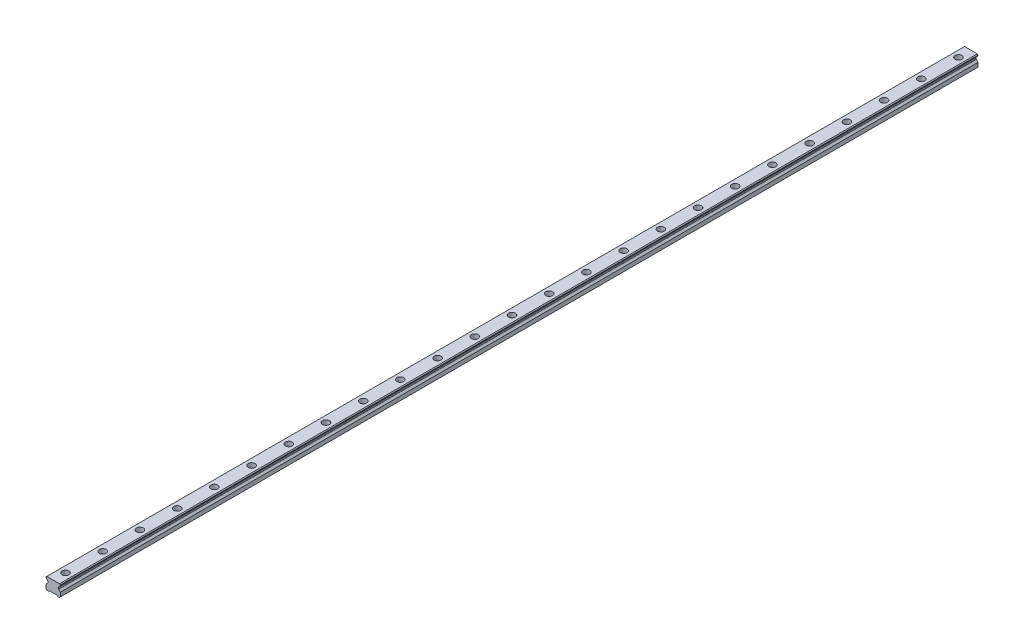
ISO-10303-21;
HEADER;
FILE_DESCRIPTION(('STEP AP214'),'2;1');
FILE_NAME('part.step','',(''),(''),'','','');
FILE_SCHEMA(('AUTOMOTIVE_DESIGN { 1 0 10303 214 1 1 1 1 }'));
ENDSEC;
DATA;
#1=APPLICATION_CONTEXT('core data for automotive mechanical design processes');
#2=APPLICATION_PROTOCOL_DEFINITION('international standard','automotive_design',2000,#1);
#3=PRODUCT_CONTEXT('',#1,'mechanical');
#4=PRODUCT('Part','Part','',(#3));
#5=PRODUCT_RELATED_PRODUCT_CATEGORY('part','',(#4));
#6=PRODUCT_DEFINITION_FORMATION('','',#4);
#7=PRODUCT_DEFINITION_CONTEXT('part definition',#1,'design');
#8=PRODUCT_DEFINITION('design','',#6,#7);
#9=PRODUCT_DEFINITION_SHAPE('','',#8);
#10=(LENGTH_UNIT() NAMED_UNIT(*) SI_UNIT(.MILLI.,.METRE.));
#11=(NAMED_UNIT(*) PLANE_ANGLE_UNIT() SI_UNIT($,.RADIAN.));
#12=(NAMED_UNIT(*) SI_UNIT($,.STERADIAN.) SOLID_ANGLE_UNIT());
#13=UNCERTAINTY_MEASURE_WITH_UNIT(LENGTH_MEASURE(1.E-05),#10,'distance_accuracy_value','');
#14=(GEOMETRIC_REPRESENTATION_CONTEXT(3) GLOBAL_UNCERTAINTY_ASSIGNED_CONTEXT((#13)) GLOBAL_UNIT_ASSIGNED_CONTEXT((#10,
#11,#12)) REPRESENTATION_CONTEXT('',''));
#15=CARTESIAN_POINT('',(0.,0.,0.));
#16=DIRECTION('',(0.,0.,1.));
#17=DIRECTION('',(1.,0.,0.));
#18=AXIS2_PLACEMENT_3D('',#15,#16,#17);
#19=CARTESIAN_POINT('',(0.,10.2,-720.));
#20=DIRECTION('',(0.,1.,0.));
#21=DIRECTION('',(0.,0.,1.));
#22=AXIS2_PLACEMENT_3D('',#19,#20,#21);
#23=PLANE('',#22);
#24=CARTESIAN_POINT('',(0.,10.2,-720.));
#25=DIRECTION('',(0.,1.,0.));
#26=DIRECTION('',(0.,0.,1.));
#27=AXIS2_PLACEMENT_3D('',#24,#25,#26);
#28=CIRCLE('',#27,3.5);
#29=CARTESIAN_POINT('',(0.,10.2,-716.5));
#30=VERTEX_POINT('',#29);
#31=EDGE_CURVE('E543',#30,#30,#28,.T.);
#32=ORIENTED_EDGE('',*,*,#31,.F.);
#33=EDGE_LOOP('',(#32));
#34=FACE_BOUND('',#33,.T.);
#35=CARTESIAN_POINT('',(0.,10.2,-720.));
#36=DIRECTION('',(0.,1.,0.));
#37=DIRECTION('',(0.,0.,1.));
#38=AXIS2_PLACEMENT_3D('',#35,#36,#37);
#39=CIRCLE('',#38,5.5);
#40=CARTESIAN_POINT('',(0.,10.2,-714.5));
#41=VERTEX_POINT('',#40);
#42=EDGE_CURVE('E11',#41,#41,#39,.T.);
#43=ORIENTED_EDGE('',*,*,#42,.T.);
#44=EDGE_LOOP('',(#43));
#45=FACE_BOUND('',#44,.T.);
#46=ADVANCED_FACE('F39',(#34,#45),#23,.T.);
#47=CARTESIAN_POINT('',(0.,10.2,-720.));
#48=DIRECTION('',(0.,1.,0.));
#49=DIRECTION('',(0.,0.,1.));
#50=AXIS2_PLACEMENT_3D('',#47,#48,#49);
#51=CYLINDRICAL_SURFACE('',#50,5.5);
#52=ORIENTED_EDGE('',*,*,#42,.F.);
#53=EDGE_LOOP('',(#52));
#54=FACE_BOUND('',#53,.T.);
#55=CARTESIAN_POINT('',(0.,19.2,-720.));
#56=DIRECTION('',(0.,1.,0.));
#57=DIRECTION('',(0.,0.,1.));
#58=AXIS2_PLACEMENT_3D('',#55,#56,#57);
#59=CIRCLE('',#58,5.5);
#60=CARTESIAN_POINT('',(0.,19.2,-714.5));
#61=VERTEX_POINT('',#60);
#62=EDGE_CURVE('E48',#61,#61,#59,.T.);
#63=ORIENTED_EDGE('',*,*,#62,.T.);
#64=EDGE_LOOP('',(#63));
#65=FACE_BOUND('',#64,.T.);
#66=ADVANCED_FACE('F949',(#54,#65),#51,.F.);
#67=CARTESIAN_POINT('',(0.,10.2,-660.));
#68=DIRECTION('',(0.,1.,0.));
#69=DIRECTION('',(0.,0.,1.));
#70=AXIS2_PLACEMENT_3D('',#67,#68,#69);
#71=PLANE('',#70);
#72=CARTESIAN_POINT('',(0.,10.2,-660.));
#73=DIRECTION('',(0.,1.,0.));
#74=DIRECTION('',(0.,0.,1.));
#75=AXIS2_PLACEMENT_3D('',#72,#73,#74);
#76=CIRCLE('',#75,3.5);
#77=CARTESIAN_POINT('',(0.,10.2,-656.5));
#78=VERTEX_POINT('',#77);
#79=EDGE_CURVE('E548',#78,#78,#76,.T.);
#80=ORIENTED_EDGE('',*,*,#79,.F.);
#81=EDGE_LOOP('',(#80));
#82=FACE_BOUND('',#81,.T.);
#83=CARTESIAN_POINT('',(0.,10.2,-660.));
#84=DIRECTION('',(0.,1.,0.));
#85=DIRECTION('',(0.,0.,1.));
#86=AXIS2_PLACEMENT_3D('',#83,#84,#85);
#87=CIRCLE('',#86,5.5);
#88=CARTESIAN_POINT('',(0.,10.2,-654.5));
#89=VERTEX_POINT('',#88);
#90=EDGE_CURVE('E527',#89,#89,#87,.T.);
#91=ORIENTED_EDGE('',*,*,#90,.T.);
#92=EDGE_LOOP('',(#91));
#93=FACE_BOUND('',#92,.T.);
#94=ADVANCED_FACE('F951',(#82,#93),#71,.T.);
#95=CARTESIAN_POINT('',(0.,10.2,-660.));
#96=DIRECTION('',(0.,1.,0.));
#97=DIRECTION('',(0.,0.,1.));
#98=AXIS2_PLACEMENT_3D('',#95,#96,#97);
#99=CYLINDRICAL_SURFACE('',#98,5.5);
#100=ORIENTED_EDGE('',*,*,#90,.F.);
#101=EDGE_LOOP('',(#100));
#102=FACE_BOUND('',#101,.T.);
#103=CARTESIAN_POINT('',(0.,19.2,-660.));
#104=DIRECTION('',(0.,1.,0.));
#105=DIRECTION('',(0.,0.,1.));
#106=AXIS2_PLACEMENT_3D('',#103,#104,#105);
#107=CIRCLE('',#106,5.5);
#108=CARTESIAN_POINT('',(0.,19.2,-654.5));
#109=VERTEX_POINT('',#108);
#110=EDGE_CURVE('E523',#109,#109,#107,.T.);
#111=ORIENTED_EDGE('',*,*,#110,.T.);
#112=EDGE_LOOP('',(#111));
#113=FACE_BOUND('',#112,.T.);
#114=ADVANCED_FACE('F957',(#102,#113),#99,.F.);
#115=CARTESIAN_POINT('',(0.,10.2,-600.));
#116=DIRECTION('',(0.,1.,0.));
#117=DIRECTION('',(0.,0.,1.));
#118=AXIS2_PLACEMENT_3D('',#115,#116,#117);
#119=PLANE('',#118);
#120=CARTESIAN_POINT('',(0.,10.2,-600.));
#121=DIRECTION('',(0.,1.,0.));
#122=DIRECTION('',(0.,0.,1.));
#123=AXIS2_PLACEMENT_3D('',#120,#121,#122);
#124=CIRCLE('',#123,3.5);
#125=CARTESIAN_POINT('',(0.,10.2,-596.5));
#126=VERTEX_POINT('',#125);
#127=EDGE_CURVE('E553',#126,#126,#124,.T.);
#128=ORIENTED_EDGE('',*,*,#127,.F.);
#129=EDGE_LOOP('',(#128));
#130=FACE_BOUND('',#129,.T.);
#131=CARTESIAN_POINT('',(0.,10.2,-600.));
#132=DIRECTION('',(0.,1.,0.));
#133=DIRECTION('',(0.,0.,1.));
#134=AXIS2_PLACEMENT_3D('',#131,#132,#133);
#135=CIRCLE('',#134,5.5);
#136=CARTESIAN_POINT('',(0.,10.2,-594.5));
#137=VERTEX_POINT('',#136);
#138=EDGE_CURVE('E519',#137,#137,#135,.T.);
#139=ORIENTED_EDGE('',*,*,#138,.T.);
#140=EDGE_LOOP('',(#139));
#141=FACE_BOUND('',#140,.T.);
#142=ADVANCED_FACE('F965',(#130,#141),#119,.T.);
#143=CARTESIAN_POINT('',(0.,10.2,-600.));
#144=DIRECTION('',(0.,1.,0.));
#145=DIRECTION('',(0.,0.,1.));
#146=AXIS2_PLACEMENT_3D('',#143,#144,#145);
#147=CYLINDRICAL_SURFACE('',#146,5.5);
#148=ORIENTED_EDGE('',*,*,#138,.F.);
#149=EDGE_LOOP('',(#148));
#150=FACE_BOUND('',#149,.T.);
#151=CARTESIAN_POINT('',(0.,19.2,-600.));
#152=DIRECTION('',(0.,1.,0.));
#153=DIRECTION('',(0.,0.,1.));
#154=AXIS2_PLACEMENT_3D('',#151,#152,#153);
#155=CIRCLE('',#154,5.5);
#156=CARTESIAN_POINT('',(0.,19.2,-594.5));
#157=VERTEX_POINT('',#156);
#158=EDGE_CURVE('E515',#157,#157,#155,.T.);
#159=ORIENTED_EDGE('',*,*,#158,.T.);
#160=EDGE_LOOP('',(#159));
#161=FACE_BOUND('',#160,.T.);
#162=ADVANCED_FACE('F969',(#150,#161),#147,.F.);
#163=CARTESIAN_POINT('',(0.,10.2,-540.));
#164=DIRECTION('',(0.,1.,0.));
#165=DIRECTION('',(0.,0.,1.));
#166=AXIS2_PLACEMENT_3D('',#163,#164,#165);
#167=PLANE('',#166);
#168=CARTESIAN_POINT('',(0.,10.2,-540.));
#169=DIRECTION('',(0.,1.,0.));
#170=DIRECTION('',(0.,0.,1.));
#171=AXIS2_PLACEMENT_3D('',#168,#169,#170);
#172=CIRCLE('',#171,3.5);
#173=CARTESIAN_POINT('',(0.,10.2,-536.5));
#174=VERTEX_POINT('',#173);
#175=EDGE_CURVE('E558',#174,#174,#172,.T.);
#176=ORIENTED_EDGE('',*,*,#175,.F.);
#177=EDGE_LOOP('',(#176));
#178=FACE_BOUND('',#177,.T.);
#179=CARTESIAN_POINT('',(0.,10.2,-540.));
#180=DIRECTION('',(0.,1.,0.));
#181=DIRECTION('',(0.,0.,1.));
#182=AXIS2_PLACEMENT_3D('',#179,#180,#181);
#183=CIRCLE('',#182,5.5);
#184=CARTESIAN_POINT('',(0.,10.2,-534.5));
#185=VERTEX_POINT('',#184);
#186=EDGE_CURVE('E511',#185,#185,#183,.T.);
#187=ORIENTED_EDGE('',*,*,#186,.T.);
#188=EDGE_LOOP('',(#187));
#189=FACE_BOUND('',#188,.T.);
#190=ADVANCED_FACE('F973',(#178,#189),#167,.T.);
#191=CARTESIAN_POINT('',(0.,10.2,-540.));
#192=DIRECTION('',(0.,1.,0.));
#193=DIRECTION('',(0.,0.,1.));
#194=AXIS2_PLACEMENT_3D('',#191,#192,#193);
#195=CYLINDRICAL_SURFACE('',#194,5.5);
#196=ORIENTED_EDGE('',*,*,#186,.F.);
#197=EDGE_LOOP('',(#196));
#198=FACE_BOUND('',#197,.T.);
#199=CARTESIAN_POINT('',(0.,19.2,-540.));
#200=DIRECTION('',(0.,1.,0.));
#201=DIRECTION('',(0.,0.,1.));
#202=AXIS2_PLACEMENT_3D('',#199,#200,#201);
#203=CIRCLE('',#202,5.5);
#204=CARTESIAN_POINT('',(0.,19.2,-534.5));
#205=VERTEX_POINT('',#204);
#206=EDGE_CURVE('E507',#205,#205,#203,.T.);
#207=ORIENTED_EDGE('',*,*,#206,.T.);
#208=EDGE_LOOP('',(#207));
#209=FACE_BOUND('',#208,.T.);
#210=ADVANCED_FACE('F977',(#198,#209),#195,.F.);
#211=CARTESIAN_POINT('',(0.,10.2,-480.));
#212=DIRECTION('',(0.,1.,0.));
#213=DIRECTION('',(0.,0.,1.));
#214=AXIS2_PLACEMENT_3D('',#211,#212,#213);
#215=PLANE('',#214);
#216=CARTESIAN_POINT('',(0.,10.2,-480.));
#217=DIRECTION('',(0.,1.,0.));
#218=DIRECTION('',(0.,0.,1.));
#219=AXIS2_PLACEMENT_3D('',#216,#217,#218);
#220=CIRCLE('',#219,3.5);
#221=CARTESIAN_POINT('',(0.,10.2,-476.5));
#222=VERTEX_POINT('',#221);
#223=EDGE_CURVE('E563',#222,#222,#220,.T.);
#224=ORIENTED_EDGE('',*,*,#223,.F.);
#225=EDGE_LOOP('',(#224));
#226=FACE_BOUND('',#225,.T.);
#227=CARTESIAN_POINT('',(0.,10.2,-480.));
#228=DIRECTION('',(0.,1.,0.));
#229=DIRECTION('',(0.,0.,1.));
#230=AXIS2_PLACEMENT_3D('',#227,#228,#229);
#231=CIRCLE('',#230,5.5);
#232=CARTESIAN_POINT('',(0.,10.2,-474.5));
#233=VERTEX_POINT('',#232);
#234=EDGE_CURVE('E503',#233,#233,#231,.T.);
#235=ORIENTED_EDGE('',*,*,#234,.T.);
#236=EDGE_LOOP('',(#235));
#237=FACE_BOUND('',#236,.T.);
#238=ADVANCED_FACE('F981',(#226,#237),#215,.T.);
#239=CARTESIAN_POINT('',(0.,10.2,-480.));
#240=DIRECTION('',(0.,1.,0.));
#241=DIRECTION('',(0.,0.,1.));
#242=AXIS2_PLACEMENT_3D('',#239,#240,#241);
#243=CYLINDRICAL_SURFACE('',#242,5.5);
#244=ORIENTED_EDGE('',*,*,#234,.F.);
#245=EDGE_LOOP('',(#244));
#246=FACE_BOUND('',#245,.T.);
#247=CARTESIAN_POINT('',(0.,19.2,-480.));
#248=DIRECTION('',(0.,1.,0.));
#249=DIRECTION('',(0.,0.,1.));
#250=AXIS2_PLACEMENT_3D('',#247,#248,#249);
#251=CIRCLE('',#250,5.5);
#252=CARTESIAN_POINT('',(0.,19.2,-474.5));
#253=VERTEX_POINT('',#252);
#254=EDGE_CURVE('E499',#253,#253,#251,.T.);
#255=ORIENTED_EDGE('',*,*,#254,.T.);
#256=EDGE_LOOP('',(#255));
#257=FACE_BOUND('',#256,.T.);
#258=ADVANCED_FACE('F985',(#246,#257),#243,.F.);
#259=CARTESIAN_POINT('',(0.,10.2,-420.));
#260=DIRECTION('',(0.,1.,0.));
#261=DIRECTION('',(0.,0.,1.));
#262=AXIS2_PLACEMENT_3D('',#259,#260,#261);
#263=PLANE('',#262);
#264=CARTESIAN_POINT('',(0.,10.2,-420.));
#265=DIRECTION('',(0.,1.,0.));
#266=DIRECTION('',(0.,0.,1.));
#267=AXIS2_PLACEMENT_3D('',#264,#265,#266);
#268=CIRCLE('',#267,3.5);
#269=CARTESIAN_POINT('',(0.,10.2,-416.5));
#270=VERTEX_POINT('',#269);
#271=EDGE_CURVE('E568',#270,#270,#268,.T.);
#272=ORIENTED_EDGE('',*,*,#271,.F.);
#273=EDGE_LOOP('',(#272));
#274=FACE_BOUND('',#273,.T.);
#275=CARTESIAN_POINT('',(0.,10.2,-420.));
#276=DIRECTION('',(0.,1.,0.));
#277=DIRECTION('',(0.,0.,1.));
#278=AXIS2_PLACEMENT_3D('',#275,#276,#277);
#279=CIRCLE('',#278,5.5);
#280=CARTESIAN_POINT('',(0.,10.2,-414.5));
#281=VERTEX_POINT('',#280);
#282=EDGE_CURVE('E495',#281,#281,#279,.T.);
#283=ORIENTED_EDGE('',*,*,#282,.T.);
#284=EDGE_LOOP('',(#283));
#285=FACE_BOUND('',#284,.T.);
#286=ADVANCED_FACE('F989',(#274,#285),#263,.T.);
#287=CARTESIAN_POINT('',(0.,10.2,-420.));
#288=DIRECTION('',(0.,1.,0.));
#289=DIRECTION('',(0.,0.,1.));
#290=AXIS2_PLACEMENT_3D('',#287,#288,#289);
#291=CYLINDRICAL_SURFACE('',#290,5.5);
#292=ORIENTED_EDGE('',*,*,#282,.F.);
#293=EDGE_LOOP('',(#292));
#294=FACE_BOUND('',#293,.T.);
#295=CARTESIAN_POINT('',(0.,19.2,-420.));
#296=DIRECTION('',(0.,1.,0.));
#297=DIRECTION('',(0.,0.,1.));
#298=AXIS2_PLACEMENT_3D('',#295,#296,#297);
#299=CIRCLE('',#298,5.5);
#300=CARTESIAN_POINT('',(0.,19.2,-414.5));
#301=VERTEX_POINT('',#300);
#302=EDGE_CURVE('E491',#301,#301,#299,.T.);
#303=ORIENTED_EDGE('',*,*,#302,.T.);
#304=EDGE_LOOP('',(#303));
#305=FACE_BOUND('',#304,.T.);
#306=ADVANCED_FACE('F993',(#294,#305),#291,.F.);
#307=CARTESIAN_POINT('',(0.,10.2,-360.));
#308=DIRECTION('',(0.,1.,0.));
#309=DIRECTION('',(0.,0.,1.));
#310=AXIS2_PLACEMENT_3D('',#307,#308,#309);
#311=PLANE('',#310);
#312=CARTESIAN_POINT('',(0.,10.2,-360.));
#313=DIRECTION('',(0.,1.,0.));
#314=DIRECTION('',(0.,0.,1.));
#315=AXIS2_PLACEMENT_3D('',#312,#313,#314);
#316=CIRCLE('',#315,3.5);
#317=CARTESIAN_POINT('',(0.,10.2,-356.5));
#318=VERTEX_POINT('',#317);
#319=EDGE_CURVE('E573',#318,#318,#316,.T.);
#320=ORIENTED_EDGE('',*,*,#319,.F.);
#321=EDGE_LOOP('',(#320));
#322=FACE_BOUND('',#321,.T.);
#323=CARTESIAN_POINT('',(0.,10.2,-360.));
#324=DIRECTION('',(0.,1.,0.));
#325=DIRECTION('',(0.,0.,1.));
#326=AXIS2_PLACEMENT_3D('',#323,#324,#325);
#327=CIRCLE('',#326,5.5);
#328=CARTESIAN_POINT('',(0.,10.2,-354.5));
#329=VERTEX_POINT('',#328);
#330=EDGE_CURVE('E487',#329,#329,#327,.T.);
#331=ORIENTED_EDGE('',*,*,#330,.T.);
#332=EDGE_LOOP('',(#331));
#333=FACE_BOUND('',#332,.T.);
#334=ADVANCED_FACE('F997',(#322,#333),#311,.T.);
#335=CARTESIAN_POINT('',(0.,10.2,-360.));
#336=DIRECTION('',(0.,1.,0.));
#337=DIRECTION('',(0.,0.,1.));
#338=AXIS2_PLACEMENT_3D('',#335,#336,#337);
#339=CYLINDRICAL_SURFACE('',#338,5.5);
#340=ORIENTED_EDGE('',*,*,#330,.F.);
#341=EDGE_LOOP('',(#340));
#342=FACE_BOUND('',#341,.T.);
#343=CARTESIAN_POINT('',(0.,19.2,-360.));
#344=DIRECTION('',(0.,1.,0.));
#345=DIRECTION('',(0.,0.,1.));
#346=AXIS2_PLACEMENT_3D('',#343,#344,#345);
#347=CIRCLE('',#346,5.5);
#348=CARTESIAN_POINT('',(0.,19.2,-354.5));
#349=VERTEX_POINT('',#348);
#350=EDGE_CURVE('E483',#349,#349,#347,.T.);
#351=ORIENTED_EDGE('',*,*,#350,.T.);
#352=EDGE_LOOP('',(#351));
#353=FACE_BOUND('',#352,.T.);
#354=ADVANCED_FACE('F1001',(#342,#353),#339,.F.);
#355=CARTESIAN_POINT('',(0.,10.2,-300.));
#356=DIRECTION('',(0.,1.,0.));
#357=DIRECTION('',(0.,0.,1.));
#358=AXIS2_PLACEMENT_3D('',#355,#356,#357);
#359=PLANE('',#358);
#360=CARTESIAN_POINT('',(0.,10.2,-300.));
#361=DIRECTION('',(0.,1.,0.));
#362=DIRECTION('',(0.,0.,1.));
#363=AXIS2_PLACEMENT_3D('',#360,#361,#362);
#364=CIRCLE('',#363,3.5);
#365=CARTESIAN_POINT('',(0.,10.2,-296.5));
#366=VERTEX_POINT('',#365);
#367=EDGE_CURVE('E578',#366,#366,#364,.T.);
#368=ORIENTED_EDGE('',*,*,#367,.F.);
#369=EDGE_LOOP('',(#368));
#370=FACE_BOUND('',#369,.T.);
#371=CARTESIAN_POINT('',(0.,10.2,-300.));
#372=DIRECTION('',(0.,1.,0.));
#373=DIRECTION('',(0.,0.,1.));
#374=AXIS2_PLACEMENT_3D('',#371,#372,#373);
#375=CIRCLE('',#374,5.5);
#376=CARTESIAN_POINT('',(0.,10.2,-294.5));
#377=VERTEX_POINT('',#376);
#378=EDGE_CURVE('E479',#377,#377,#375,.T.);
#379=ORIENTED_EDGE('',*,*,#378,.T.);
#380=EDGE_LOOP('',(#379));
#381=FACE_BOUND('',#380,.T.);
#382=ADVANCED_FACE('F1005',(#370,#381),#359,.T.);
#383=CARTESIAN_POINT('',(0.,10.2,-300.));
#384=DIRECTION('',(0.,1.,0.));
#385=DIRECTION('',(0.,0.,1.));
#386=AXIS2_PLACEMENT_3D('',#383,#384,#385);
#387=CYLINDRICAL_SURFACE('',#386,5.5);
#388=ORIENTED_EDGE('',*,*,#378,.F.);
#389=EDGE_LOOP('',(#388));
#390=FACE_BOUND('',#389,.T.);
#391=CARTESIAN_POINT('',(0.,19.2,-300.));
#392=DIRECTION('',(0.,1.,0.));
#393=DIRECTION('',(0.,0.,1.));
#394=AXIS2_PLACEMENT_3D('',#391,#392,#393);
#395=CIRCLE('',#394,5.5);
#396=CARTESIAN_POINT('',(0.,19.2,-294.5));
#397=VERTEX_POINT('',#396);
#398=EDGE_CURVE('E475',#397,#397,#395,.T.);
#399=ORIENTED_EDGE('',*,*,#398,.T.);
#400=EDGE_LOOP('',(#399));
#401=FACE_BOUND('',#400,.T.);
#402=ADVANCED_FACE('F1009',(#390,#401),#387,.F.);
#403=CARTESIAN_POINT('',(0.,10.2,-240.));
#404=DIRECTION('',(0.,1.,0.));
#405=DIRECTION('',(0.,0.,1.));
#406=AXIS2_PLACEMENT_3D('',#403,#404,#405);
#407=PLANE('',#406);
#408=CARTESIAN_POINT('',(0.,10.2,-240.));
#409=DIRECTION('',(0.,1.,0.));
#410=DIRECTION('',(0.,0.,1.));
#411=AXIS2_PLACEMENT_3D('',#408,#409,#410);
#412=CIRCLE('',#411,3.5);
#413=CARTESIAN_POINT('',(0.,10.2,-236.5));
#414=VERTEX_POINT('',#413);
#415=EDGE_CURVE('E583',#414,#414,#412,.T.);
#416=ORIENTED_EDGE('',*,*,#415,.F.);
#417=EDGE_LOOP('',(#416));
#418=FACE_BOUND('',#417,.T.);
#419=CARTESIAN_POINT('',(0.,10.2,-240.));
#420=DIRECTION('',(0.,1.,0.));
#421=DIRECTION('',(0.,0.,1.));
#422=AXIS2_PLACEMENT_3D('',#419,#420,#421);
#423=CIRCLE('',#422,5.5);
#424=CARTESIAN_POINT('',(0.,10.2,-234.5));
#425=VERTEX_POINT('',#424);
#426=EDGE_CURVE('E471',#425,#425,#423,.T.);
#427=ORIENTED_EDGE('',*,*,#426,.T.);
#428=EDGE_LOOP('',(#427));
#429=FACE_BOUND('',#428,.T.);
#430=ADVANCED_FACE('F1013',(#418,#429),#407,.T.);
#431=CARTESIAN_POINT('',(0.,10.2,-240.));
#432=DIRECTION('',(0.,1.,0.));
#433=DIRECTION('',(0.,0.,1.));
#434=AXIS2_PLACEMENT_3D('',#431,#432,#433);
#435=CYLINDRICAL_SURFACE('',#434,5.5);
#436=ORIENTED_EDGE('',*,*,#426,.F.);
#437=EDGE_LOOP('',(#436));
#438=FACE_BOUND('',#437,.T.);
#439=CARTESIAN_POINT('',(0.,19.2,-240.));
#440=DIRECTION('',(0.,1.,0.));
#441=DIRECTION('',(0.,0.,1.));
#442=AXIS2_PLACEMENT_3D('',#439,#440,#441);
#443=CIRCLE('',#442,5.5);
#444=CARTESIAN_POINT('',(0.,19.2,-234.5));
#445=VERTEX_POINT('',#444);
#446=EDGE_CURVE('E467',#445,#445,#443,.T.);
#447=ORIENTED_EDGE('',*,*,#446,.T.);
#448=EDGE_LOOP('',(#447));
#449=FACE_BOUND('',#448,.T.);
#450=ADVANCED_FACE('F1017',(#438,#449),#435,.F.);
#451=CARTESIAN_POINT('',(0.,10.2,-180.));
#452=DIRECTION('',(0.,1.,0.));
#453=DIRECTION('',(0.,0.,1.));
#454=AXIS2_PLACEMENT_3D('',#451,#452,#453);
#455=PLANE('',#454);
#456=CARTESIAN_POINT('',(0.,10.2,-180.));
#457=DIRECTION('',(0.,1.,0.));
#458=DIRECTION('',(0.,0.,1.));
#459=AXIS2_PLACEMENT_3D('',#456,#457,#458);
#460=CIRCLE('',#459,3.5);
#461=CARTESIAN_POINT('',(0.,10.2,-176.5));
#462=VERTEX_POINT('',#461);
#463=EDGE_CURVE('E588',#462,#462,#460,.T.);
#464=ORIENTED_EDGE('',*,*,#463,.F.);
#465=EDGE_LOOP('',(#464));
#466=FACE_BOUND('',#465,.T.);
#467=CARTESIAN_POINT('',(0.,10.2,-180.));
#468=DIRECTION('',(0.,1.,0.));
#469=DIRECTION('',(0.,0.,1.));
#470=AXIS2_PLACEMENT_3D('',#467,#468,#469);
#471=CIRCLE('',#470,5.5);
#472=CARTESIAN_POINT('',(0.,10.2,-174.5));
#473=VERTEX_POINT('',#472);
#474=EDGE_CURVE('E463',#473,#473,#471,.T.);
#475=ORIENTED_EDGE('',*,*,#474,.T.);
#476=EDGE_LOOP('',(#475));
#477=FACE_BOUND('',#476,.T.);
#478=ADVANCED_FACE('F1021',(#466,#477),#455,.T.);
#479=CARTESIAN_POINT('',(0.,10.2,-180.));
#480=DIRECTION('',(0.,1.,0.));
#481=DIRECTION('',(0.,0.,1.));
#482=AXIS2_PLACEMENT_3D('',#479,#480,#481);
#483=CYLINDRICAL_SURFACE('',#482,5.5);
#484=ORIENTED_EDGE('',*,*,#474,.F.);
#485=EDGE_LOOP('',(#484));
#486=FACE_BOUND('',#485,.T.);
#487=CARTESIAN_POINT('',(0.,19.2,-180.));
#488=DIRECTION('',(0.,1.,0.));
#489=DIRECTION('',(0.,0.,1.));
#490=AXIS2_PLACEMENT_3D('',#487,#488,#489);
#491=CIRCLE('',#490,5.5);
#492=CARTESIAN_POINT('',(0.,19.2,-174.5));
#493=VERTEX_POINT('',#492);
#494=EDGE_CURVE('E459',#493,#493,#491,.T.);
#495=ORIENTED_EDGE('',*,*,#494,.T.);
#496=EDGE_LOOP('',(#495));
#497=FACE_BOUND('',#496,.T.);
#498=ADVANCED_FACE('F1025',(#486,#497),#483,.F.);
#499=CARTESIAN_POINT('',(0.,10.2,-120.));
#500=DIRECTION('',(0.,1.,0.));
#501=DIRECTION('',(0.,0.,1.));
#502=AXIS2_PLACEMENT_3D('',#499,#500,#501);
#503=PLANE('',#502);
#504=CARTESIAN_POINT('',(0.,10.2,-120.));
#505=DIRECTION('',(0.,1.,0.));
#506=DIRECTION('',(0.,0.,1.));
#507=AXIS2_PLACEMENT_3D('',#504,#505,#506);
#508=CIRCLE('',#507,3.5);
#509=CARTESIAN_POINT('',(0.,10.2,-116.5));
#510=VERTEX_POINT('',#509);
#511=EDGE_CURVE('E593',#510,#510,#508,.T.);
#512=ORIENTED_EDGE('',*,*,#511,.F.);
#513=EDGE_LOOP('',(#512));
#514=FACE_BOUND('',#513,.T.);
#515=CARTESIAN_POINT('',(0.,10.2,-120.));
#516=DIRECTION('',(0.,1.,0.));
#517=DIRECTION('',(0.,0.,1.));
#518=AXIS2_PLACEMENT_3D('',#515,#516,#517);
#519=CIRCLE('',#518,5.5);
#520=CARTESIAN_POINT('',(0.,10.2,-114.5));
#521=VERTEX_POINT('',#520);
#522=EDGE_CURVE('E455',#521,#521,#519,.T.);
#523=ORIENTED_EDGE('',*,*,#522,.T.);
#524=EDGE_LOOP('',(#523));
#525=FACE_BOUND('',#524,.T.);
#526=ADVANCED_FACE('F1029',(#514,#525),#503,.T.);
#527=CARTESIAN_POINT('',(0.,10.2,-120.));
#528=DIRECTION('',(0.,1.,0.));
#529=DIRECTION('',(0.,0.,1.));
#530=AXIS2_PLACEMENT_3D('',#527,#528,#529);
#531=CYLINDRICAL_SURFACE('',#530,5.5);
#532=ORIENTED_EDGE('',*,*,#522,.F.);
#533=EDGE_LOOP('',(#532));
#534=FACE_BOUND('',#533,.T.);
#535=CARTESIAN_POINT('',(0.,19.2,-120.));
#536=DIRECTION('',(0.,1.,0.));
#537=DIRECTION('',(0.,0.,1.));
#538=AXIS2_PLACEMENT_3D('',#535,#536,#537);
#539=CIRCLE('',#538,5.5);
#540=CARTESIAN_POINT('',(0.,19.2,-114.5));
#541=VERTEX_POINT('',#540);
#542=EDGE_CURVE('E451',#541,#541,#539,.T.);
#543=ORIENTED_EDGE('',*,*,#542,.T.);
#544=EDGE_LOOP('',(#543));
#545=FACE_BOUND('',#544,.T.);
#546=ADVANCED_FACE('F1033',(#534,#545),#531,.F.);
#547=CARTESIAN_POINT('',(0.,10.2,-60.0000000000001));
#548=DIRECTION('',(0.,1.,0.));
#549=DIRECTION('',(0.,0.,1.));
#550=AXIS2_PLACEMENT_3D('',#547,#548,#549);
#551=PLANE('',#550);
#552=CARTESIAN_POINT('',(0.,10.2,-60.0000000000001));
#553=DIRECTION('',(0.,1.,0.));
#554=DIRECTION('',(0.,0.,1.));
#555=AXIS2_PLACEMENT_3D('',#552,#553,#554);
#556=CIRCLE('',#555,3.5);
#557=CARTESIAN_POINT('',(0.,10.2,-56.5));
#558=VERTEX_POINT('',#557);
#559=EDGE_CURVE('E598',#558,#558,#556,.T.);
#560=ORIENTED_EDGE('',*,*,#559,.F.);
#561=EDGE_LOOP('',(#560));
#562=FACE_BOUND('',#561,.T.);
#563=CARTESIAN_POINT('',(0.,10.2,-60.0000000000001));
#564=DIRECTION('',(0.,1.,0.));
#565=DIRECTION('',(0.,0.,1.));
#566=AXIS2_PLACEMENT_3D('',#563,#564,#565);
#567=CIRCLE('',#566,5.5);
#568=CARTESIAN_POINT('',(0.,10.2,-54.5000000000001));
#569=VERTEX_POINT('',#568);
#570=EDGE_CURVE('E447',#569,#569,#567,.T.);
#571=ORIENTED_EDGE('',*,*,#570,.T.);
#572=EDGE_LOOP('',(#571));
#573=FACE_BOUND('',#572,.T.);
#574=ADVANCED_FACE('F1037',(#562,#573),#551,.T.);
#575=CARTESIAN_POINT('',(0.,10.2,-60.0000000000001));
#576=DIRECTION('',(0.,1.,0.));
#577=DIRECTION('',(0.,0.,1.));
#578=AXIS2_PLACEMENT_3D('',#575,#576,#577);
#579=CYLINDRICAL_SURFACE('',#578,5.5);
#580=ORIENTED_EDGE('',*,*,#570,.F.);
#581=EDGE_LOOP('',(#580));
#582=FACE_BOUND('',#581,.T.);
#583=CARTESIAN_POINT('',(0.,19.2,-60.0000000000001));
#584=DIRECTION('',(0.,1.,0.));
#585=DIRECTION('',(0.,0.,1.));
#586=AXIS2_PLACEMENT_3D('',#583,#584,#585);
#587=CIRCLE('',#586,5.5);
#588=CARTESIAN_POINT('',(0.,19.2,-54.5000000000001));
#589=VERTEX_POINT('',#588);
#590=EDGE_CURVE('E443',#589,#589,#587,.T.);
#591=ORIENTED_EDGE('',*,*,#590,.T.);
#592=EDGE_LOOP('',(#591));
#593=FACE_BOUND('',#592,.T.);
#594=ADVANCED_FACE('F1041',(#582,#593),#579,.F.);
#595=CARTESIAN_POINT('',(0.,10.2,0.));
#596=DIRECTION('',(0.,1.,0.));
#597=DIRECTION('',(0.,0.,1.));
#598=AXIS2_PLACEMENT_3D('',#595,#596,#597);
#599=PLANE('',#598);
#600=CARTESIAN_POINT('',(0.,10.2,0.));
#601=DIRECTION('',(0.,1.,0.));
#602=DIRECTION('',(0.,0.,1.));
#603=AXIS2_PLACEMENT_3D('',#600,#601,#602);
#604=CIRCLE('',#603,3.5);
#605=CARTESIAN_POINT('',(0.,10.2,3.5));
#606=VERTEX_POINT('',#605);
#607=EDGE_CURVE('E603',#606,#606,#604,.T.);
#608=ORIENTED_EDGE('',*,*,#607,.F.);
#609=EDGE_LOOP('',(#608));
#610=FACE_BOUND('',#609,.T.);
#611=CARTESIAN_POINT('',(0.,10.2,0.));
#612=DIRECTION('',(0.,1.,0.));
#613=DIRECTION('',(0.,0.,1.));
#614=AXIS2_PLACEMENT_3D('',#611,#612,#613);
#615=CIRCLE('',#614,5.5);
#616=CARTESIAN_POINT('',(0.,10.2,5.5));
#617=VERTEX_POINT('',#616);
#618=EDGE_CURVE('E439',#617,#617,#615,.T.);
#619=ORIENTED_EDGE('',*,*,#618,.T.);
#620=EDGE_LOOP('',(#619));
#621=FACE_BOUND('',#620,.T.);
#622=ADVANCED_FACE('F1045',(#610,#621),#599,.T.);
#623=CARTESIAN_POINT('',(0.,10.2,0.));
#624=DIRECTION('',(0.,1.,0.));
#625=DIRECTION('',(0.,0.,1.));
#626=AXIS2_PLACEMENT_3D('',#623,#624,#625);
#627=CYLINDRICAL_SURFACE('',#626,5.5);
#628=ORIENTED_EDGE('',*,*,#618,.F.);
#629=EDGE_LOOP('',(#628));
#630=FACE_BOUND('',#629,.T.);
#631=CARTESIAN_POINT('',(0.,19.2,0.));
#632=DIRECTION('',(0.,1.,0.));
#633=DIRECTION('',(0.,0.,1.));
#634=AXIS2_PLACEMENT_3D('',#631,#632,#633);
#635=CIRCLE('',#634,5.5);
#636=CARTESIAN_POINT('',(0.,19.2,5.5));
#637=VERTEX_POINT('',#636);
#638=EDGE_CURVE('E435',#637,#637,#635,.T.);
#639=ORIENTED_EDGE('',*,*,#638,.T.);
#640=EDGE_LOOP('',(#639));
#641=FACE_BOUND('',#640,.T.);
#642=ADVANCED_FACE('F1049',(#630,#641),#627,.F.);
#643=CARTESIAN_POINT('',(0.,10.2,60.0000000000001));
#644=DIRECTION('',(0.,1.,0.));
#645=DIRECTION('',(0.,0.,1.));
#646=AXIS2_PLACEMENT_3D('',#643,#644,#645);
#647=PLANE('',#646);
#648=CARTESIAN_POINT('',(0.,10.2,60.0000000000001));
#649=DIRECTION('',(0.,1.,0.));
#650=DIRECTION('',(0.,0.,1.));
#651=AXIS2_PLACEMENT_3D('',#648,#649,#650);
#652=CIRCLE('',#651,3.5);
#653=CARTESIAN_POINT('',(0.,10.2,63.5000000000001));
#654=VERTEX_POINT('',#653);
#655=EDGE_CURVE('E608',#654,#654,#652,.T.);
#656=ORIENTED_EDGE('',*,*,#655,.F.);
#657=EDGE_LOOP('',(#656));
#658=FACE_BOUND('',#657,.T.);
#659=CARTESIAN_POINT('',(0.,10.2,60.0000000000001));
#660=DIRECTION('',(0.,1.,0.));
#661=DIRECTION('',(0.,0.,1.));
#662=AXIS2_PLACEMENT_3D('',#659,#660,#661);
#663=CIRCLE('',#662,5.5);
#664=CARTESIAN_POINT('',(0.,10.2,65.5000000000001));
#665=VERTEX_POINT('',#664);
#666=EDGE_CURVE('E431',#665,#665,#663,.T.);
#667=ORIENTED_EDGE('',*,*,#666,.T.);
#668=EDGE_LOOP('',(#667));
#669=FACE_BOUND('',#668,.T.);
#670=ADVANCED_FACE('F1053',(#658,#669),#647,.T.);
#671=CARTESIAN_POINT('',(0.,10.2,60.0000000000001));
#672=DIRECTION('',(0.,1.,0.));
#673=DIRECTION('',(0.,0.,1.));
#674=AXIS2_PLACEMENT_3D('',#671,#672,#673);
#675=CYLINDRICAL_SURFACE('',#674,5.5);
#676=ORIENTED_EDGE('',*,*,#666,.F.);
#677=EDGE_LOOP('',(#676));
#678=FACE_BOUND('',#677,.T.);
#679=CARTESIAN_POINT('',(0.,19.2,60.0000000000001));
#680=DIRECTION('',(0.,1.,0.));
#681=DIRECTION('',(0.,0.,1.));
#682=AXIS2_PLACEMENT_3D('',#679,#680,#681);
#683=CIRCLE('',#682,5.5);
#684=CARTESIAN_POINT('',(0.,19.2,65.5000000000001));
#685=VERTEX_POINT('',#684);
#686=EDGE_CURVE('E427',#685,#685,#683,.T.);
#687=ORIENTED_EDGE('',*,*,#686,.T.);
#688=EDGE_LOOP('',(#687));
#689=FACE_BOUND('',#688,.T.);
#690=ADVANCED_FACE('F1057',(#678,#689),#675,.F.);
#691=CARTESIAN_POINT('',(0.,10.2,120.));
#692=DIRECTION('',(0.,1.,0.));
#693=DIRECTION('',(0.,0.,1.));
#694=AXIS2_PLACEMENT_3D('',#691,#692,#693);
#695=PLANE('',#694);
#696=CARTESIAN_POINT('',(0.,10.2,120.));
#697=DIRECTION('',(0.,1.,0.));
#698=DIRECTION('',(0.,0.,1.));
#699=AXIS2_PLACEMENT_3D('',#696,#697,#698);
#700=CIRCLE('',#699,3.5);
#701=CARTESIAN_POINT('',(0.,10.2,123.5));
#702=VERTEX_POINT('',#701);
#703=EDGE_CURVE('E613',#702,#702,#700,.T.);
#704=ORIENTED_EDGE('',*,*,#703,.F.);
#705=EDGE_LOOP('',(#704));
#706=FACE_BOUND('',#705,.T.);
#707=CARTESIAN_POINT('',(0.,10.2,120.));
#708=DIRECTION('',(0.,1.,0.));
#709=DIRECTION('',(0.,0.,1.));
#710=AXIS2_PLACEMENT_3D('',#707,#708,#709);
#711=CIRCLE('',#710,5.5);
#712=CARTESIAN_POINT('',(0.,10.2,125.5));
#713=VERTEX_POINT('',#712);
#714=EDGE_CURVE('E423',#713,#713,#711,.T.);
#715=ORIENTED_EDGE('',*,*,#714,.T.);
#716=EDGE_LOOP('',(#715));
#717=FACE_BOUND('',#716,.T.);
#718=ADVANCED_FACE('F1061',(#706,#717),#695,.T.);
#719=CARTESIAN_POINT('',(0.,10.2,120.));
#720=DIRECTION('',(0.,1.,0.));
#721=DIRECTION('',(0.,0.,1.));
#722=AXIS2_PLACEMENT_3D('',#719,#720,#721);
#723=CYLINDRICAL_SURFACE('',#722,5.5);
#724=ORIENTED_EDGE('',*,*,#714,.F.);
#725=EDGE_LOOP('',(#724));
#726=FACE_BOUND('',#725,.T.);
#727=CARTESIAN_POINT('',(0.,19.2,120.));
#728=DIRECTION('',(0.,1.,0.));
#729=DIRECTION('',(0.,0.,1.));
#730=AXIS2_PLACEMENT_3D('',#727,#728,#729);
#731=CIRCLE('',#730,5.5);
#732=CARTESIAN_POINT('',(0.,19.2,125.5));
#733=VERTEX_POINT('',#732);
#734=EDGE_CURVE('E419',#733,#733,#731,.T.);
#735=ORIENTED_EDGE('',*,*,#734,.T.);
#736=EDGE_LOOP('',(#735));
#737=FACE_BOUND('',#736,.T.);
#738=ADVANCED_FACE('F1065',(#726,#737),#723,.F.);
#739=CARTESIAN_POINT('',(0.,10.2,180.));
#740=DIRECTION('',(0.,1.,0.));
#741=DIRECTION('',(0.,0.,1.));
#742=AXIS2_PLACEMENT_3D('',#739,#740,#741);
#743=PLANE('',#742);
#744=CARTESIAN_POINT('',(0.,10.2,180.));
#745=DIRECTION('',(0.,1.,0.));
#746=DIRECTION('',(0.,0.,1.));
#747=AXIS2_PLACEMENT_3D('',#744,#745,#746);
#748=CIRCLE('',#747,3.5);
#749=CARTESIAN_POINT('',(0.,10.2,183.5));
#750=VERTEX_POINT('',#749);
#751=EDGE_CURVE('E618',#750,#750,#748,.T.);
#752=ORIENTED_EDGE('',*,*,#751,.F.);
#753=EDGE_LOOP('',(#752));
#754=FACE_BOUND('',#753,.T.);
#755=CARTESIAN_POINT('',(0.,10.2,180.));
#756=DIRECTION('',(0.,1.,0.));
#757=DIRECTION('',(0.,0.,1.));
#758=AXIS2_PLACEMENT_3D('',#755,#756,#757);
#759=CIRCLE('',#758,5.5);
#760=CARTESIAN_POINT('',(0.,10.2,185.5));
#761=VERTEX_POINT('',#760);
#762=EDGE_CURVE('E415',#761,#761,#759,.T.);
#763=ORIENTED_EDGE('',*,*,#762,.T.);
#764=EDGE_LOOP('',(#763));
#765=FACE_BOUND('',#764,.T.);
#766=ADVANCED_FACE('F1069',(#754,#765),#743,.T.);
#767=CARTESIAN_POINT('',(0.,10.2,180.));
#768=DIRECTION('',(0.,1.,0.));
#769=DIRECTION('',(0.,0.,1.));
#770=AXIS2_PLACEMENT_3D('',#767,#768,#769);
#771=CYLINDRICAL_SURFACE('',#770,5.5);
#772=ORIENTED_EDGE('',*,*,#762,.F.);
#773=EDGE_LOOP('',(#772));
#774=FACE_BOUND('',#773,.T.);
#775=CARTESIAN_POINT('',(0.,19.2,180.));
#776=DIRECTION('',(0.,1.,0.));
#777=DIRECTION('',(0.,0.,1.));
#778=AXIS2_PLACEMENT_3D('',#775,#776,#777);
#779=CIRCLE('',#778,5.5);
#780=CARTESIAN_POINT('',(0.,19.2,185.5));
#781=VERTEX_POINT('',#780);
#782=EDGE_CURVE('E411',#781,#781,#779,.T.);
#783=ORIENTED_EDGE('',*,*,#782,.T.);
#784=EDGE_LOOP('',(#783));
#785=FACE_BOUND('',#784,.T.);
#786=ADVANCED_FACE('F1073',(#774,#785),#771,.F.);
#787=CARTESIAN_POINT('',(0.,10.2,240.));
#788=DIRECTION('',(0.,1.,0.));
#789=DIRECTION('',(0.,0.,1.));
#790=AXIS2_PLACEMENT_3D('',#787,#788,#789);
#791=PLANE('',#790);
#792=CARTESIAN_POINT('',(0.,10.2,240.));
#793=DIRECTION('',(0.,1.,0.));
#794=DIRECTION('',(0.,0.,1.));
#795=AXIS2_PLACEMENT_3D('',#792,#793,#794);
#796=CIRCLE('',#795,3.5);
#797=CARTESIAN_POINT('',(0.,10.2,243.5));
#798=VERTEX_POINT('',#797);
#799=EDGE_CURVE('E623',#798,#798,#796,.T.);
#800=ORIENTED_EDGE('',*,*,#799,.F.);
#801=EDGE_LOOP('',(#800));
#802=FACE_BOUND('',#801,.T.);
#803=CARTESIAN_POINT('',(0.,10.2,240.));
#804=DIRECTION('',(0.,1.,0.));
#805=DIRECTION('',(0.,0.,1.));
#806=AXIS2_PLACEMENT_3D('',#803,#804,#805);
#807=CIRCLE('',#806,5.5);
#808=CARTESIAN_POINT('',(0.,10.2,245.5));
#809=VERTEX_POINT('',#808);
#810=EDGE_CURVE('E407',#809,#809,#807,.T.);
#811=ORIENTED_EDGE('',*,*,#810,.T.);
#812=EDGE_LOOP('',(#811));
#813=FACE_BOUND('',#812,.T.);
#814=ADVANCED_FACE('F1077',(#802,#813),#791,.T.);
#815=CARTESIAN_POINT('',(0.,10.2,240.));
#816=DIRECTION('',(0.,1.,0.));
#817=DIRECTION('',(0.,0.,1.));
#818=AXIS2_PLACEMENT_3D('',#815,#816,#817);
#819=CYLINDRICAL_SURFACE('',#818,5.5);
#820=ORIENTED_EDGE('',*,*,#810,.F.);
#821=EDGE_LOOP('',(#820));
#822=FACE_BOUND('',#821,.T.);
#823=CARTESIAN_POINT('',(0.,19.2,240.));
#824=DIRECTION('',(0.,1.,0.));
#825=DIRECTION('',(0.,0.,1.));
#826=AXIS2_PLACEMENT_3D('',#823,#824,#825);
#827=CIRCLE('',#826,5.5);
#828=CARTESIAN_POINT('',(0.,19.2,245.5));
#829=VERTEX_POINT('',#828);
#830=EDGE_CURVE('E403',#829,#829,#827,.T.);
#831=ORIENTED_EDGE('',*,*,#830,.T.);
#832=EDGE_LOOP('',(#831));
#833=FACE_BOUND('',#832,.T.);
#834=ADVANCED_FACE('F1081',(#822,#833),#819,.F.);
#835=CARTESIAN_POINT('',(0.,10.2,300.));
#836=DIRECTION('',(0.,1.,0.));
#837=DIRECTION('',(0.,0.,1.));
#838=AXIS2_PLACEMENT_3D('',#835,#836,#837);
#839=PLANE('',#838);
#840=CARTESIAN_POINT('',(0.,10.2,300.));
#841=DIRECTION('',(0.,1.,0.));
#842=DIRECTION('',(0.,0.,1.));
#843=AXIS2_PLACEMENT_3D('',#840,#841,#842);
#844=CIRCLE('',#843,3.5);
#845=CARTESIAN_POINT('',(0.,10.2,303.5));
#846=VERTEX_POINT('',#845);
#847=EDGE_CURVE('E628',#846,#846,#844,.T.);
#848=ORIENTED_EDGE('',*,*,#847,.F.);
#849=EDGE_LOOP('',(#848));
#850=FACE_BOUND('',#849,.T.);
#851=CARTESIAN_POINT('',(0.,10.2,300.));
#852=DIRECTION('',(0.,1.,0.));
#853=DIRECTION('',(0.,0.,1.));
#854=AXIS2_PLACEMENT_3D('',#851,#852,#853);
#855=CIRCLE('',#854,5.5);
#856=CARTESIAN_POINT('',(0.,10.2,305.5));
#857=VERTEX_POINT('',#856);
#858=EDGE_CURVE('E399',#857,#857,#855,.T.);
#859=ORIENTED_EDGE('',*,*,#858,.T.);
#860=EDGE_LOOP('',(#859));
#861=FACE_BOUND('',#860,.T.);
#862=ADVANCED_FACE('F1085',(#850,#861),#839,.T.);
#863=CARTESIAN_POINT('',(0.,10.2,300.));
#864=DIRECTION('',(0.,1.,0.));
#865=DIRECTION('',(0.,0.,1.));
#866=AXIS2_PLACEMENT_3D('',#863,#864,#865);
#867=CYLINDRICAL_SURFACE('',#866,5.5);
#868=ORIENTED_EDGE('',*,*,#858,.F.);
#869=EDGE_LOOP('',(#868));
#870=FACE_BOUND('',#869,.T.);
#871=CARTESIAN_POINT('',(0.,19.2,300.));
#872=DIRECTION('',(0.,1.,0.));
#873=DIRECTION('',(0.,0.,1.));
#874=AXIS2_PLACEMENT_3D('',#871,#872,#873);
#875=CIRCLE('',#874,5.5);
#876=CARTESIAN_POINT('',(0.,19.2,305.5));
#877=VERTEX_POINT('',#876);
#878=EDGE_CURVE('E395',#877,#877,#875,.T.);
#879=ORIENTED_EDGE('',*,*,#878,.T.);
#880=EDGE_LOOP('',(#879));
#881=FACE_BOUND('',#880,.T.);
#882=ADVANCED_FACE('F897',(#870,#881),#867,.F.);
#883=CARTESIAN_POINT('',(0.,10.2,360.));
#884=DIRECTION('',(0.,1.,0.));
#885=DIRECTION('',(0.,0.,1.));
#886=AXIS2_PLACEMENT_3D('',#883,#884,#885);
#887=PLANE('',#886);
#888=CARTESIAN_POINT('',(0.,10.2,360.));
#889=DIRECTION('',(0.,1.,0.));
#890=DIRECTION('',(0.,0.,1.));
#891=AXIS2_PLACEMENT_3D('',#888,#889,#890);
#892=CIRCLE('',#891,3.5);
#893=CARTESIAN_POINT('',(0.,10.2,363.5));
#894=VERTEX_POINT('',#893);
#895=EDGE_CURVE('E632',#894,#894,#892,.T.);
#896=ORIENTED_EDGE('',*,*,#895,.F.);
#897=EDGE_LOOP('',(#896));
#898=FACE_BOUND('',#897,.T.);
#899=CARTESIAN_POINT('',(0.,10.2,360.));
#900=DIRECTION('',(0.,1.,0.));
#901=DIRECTION('',(0.,0.,1.));
#902=AXIS2_PLACEMENT_3D('',#899,#900,#901);
#903=CIRCLE('',#902,5.5);
#904=CARTESIAN_POINT('',(0.,10.2,365.5));
#905=VERTEX_POINT('',#904);
#906=EDGE_CURVE('E391',#905,#905,#903,.T.);
#907=ORIENTED_EDGE('',*,*,#906,.T.);
#908=EDGE_LOOP('',(#907));
#909=FACE_BOUND('',#908,.T.);
#910=ADVANCED_FACE('F893',(#898,#909),#887,.T.);
#911=CARTESIAN_POINT('',(0.,10.2,360.));
#912=DIRECTION('',(0.,1.,0.));
#913=DIRECTION('',(0.,0.,1.));
#914=AXIS2_PLACEMENT_3D('',#911,#912,#913);
#915=CYLINDRICAL_SURFACE('',#914,5.5);
#916=ORIENTED_EDGE('',*,*,#906,.F.);
#917=EDGE_LOOP('',(#916));
#918=FACE_BOUND('',#917,.T.);
#919=CARTESIAN_POINT('',(0.,19.2,360.));
#920=DIRECTION('',(0.,1.,0.));
#921=DIRECTION('',(0.,0.,1.));
#922=AXIS2_PLACEMENT_3D('',#919,#920,#921);
#923=CIRCLE('',#922,5.5);
#924=CARTESIAN_POINT('',(0.,19.2,365.5));
#925=VERTEX_POINT('',#924);
#926=EDGE_CURVE('E387',#925,#925,#923,.T.);
#927=ORIENTED_EDGE('',*,*,#926,.T.);
#928=EDGE_LOOP('',(#927));
#929=FACE_BOUND('',#928,.T.);
#930=ADVANCED_FACE('F896',(#918,#929),#915,.F.);
#931=CARTESIAN_POINT('',(0.,10.2,420.));
#932=DIRECTION('',(0.,1.,0.));
#933=DIRECTION('',(0.,0.,1.));
#934=AXIS2_PLACEMENT_3D('',#931,#932,#933);
#935=PLANE('',#934);
#936=CARTESIAN_POINT('',(0.,10.2,420.));
#937=DIRECTION('',(0.,1.,0.));
#938=DIRECTION('',(0.,0.,1.));
#939=AXIS2_PLACEMENT_3D('',#936,#937,#938);
#940=CIRCLE('',#939,3.5);
#941=CARTESIAN_POINT('',(0.,10.2,423.5));
#942=VERTEX_POINT('',#941);
#943=EDGE_CURVE('E637',#942,#942,#940,.T.);
#944=ORIENTED_EDGE('',*,*,#943,.F.);
#945=EDGE_LOOP('',(#944));
#946=FACE_BOUND('',#945,.T.);
#947=CARTESIAN_POINT('',(0.,10.2,420.));
#948=DIRECTION('',(0.,1.,0.));
#949=DIRECTION('',(0.,0.,1.));
#950=AXIS2_PLACEMENT_3D('',#947,#948,#949);
#951=CIRCLE('',#950,5.5);
#952=CARTESIAN_POINT('',(0.,10.2,425.5));
#953=VERTEX_POINT('',#952);
#954=EDGE_CURVE('E383',#953,#953,#951,.T.);
#955=ORIENTED_EDGE('',*,*,#954,.T.);
#956=EDGE_LOOP('',(#955));
#957=FACE_BOUND('',#956,.T.);
#958=ADVANCED_FACE('F903',(#946,#957),#935,.T.);
#959=CARTESIAN_POINT('',(0.,10.2,420.));
#960=DIRECTION('',(0.,1.,0.));
#961=DIRECTION('',(0.,0.,1.));
#962=AXIS2_PLACEMENT_3D('',#959,#960,#961);
#963=CYLINDRICAL_SURFACE('',#962,5.5);
#964=ORIENTED_EDGE('',*,*,#954,.F.);
#965=EDGE_LOOP('',(#964));
#966=FACE_BOUND('',#965,.T.);
#967=CARTESIAN_POINT('',(0.,19.2,420.));
#968=DIRECTION('',(0.,1.,0.));
#969=DIRECTION('',(0.,0.,1.));
#970=AXIS2_PLACEMENT_3D('',#967,#968,#969);
#971=CIRCLE('',#970,5.5);
#972=CARTESIAN_POINT('',(0.,19.2,425.5));
#973=VERTEX_POINT('',#972);
#974=EDGE_CURVE('E379',#973,#973,#971,.T.);
#975=ORIENTED_EDGE('',*,*,#974,.T.);
#976=EDGE_LOOP('',(#975));
#977=FACE_BOUND('',#976,.T.);
#978=ADVANCED_FACE('F1095',(#966,#977),#963,.F.);
#979=CARTESIAN_POINT('',(0.,10.2,480.));
#980=DIRECTION('',(0.,1.,0.));
#981=DIRECTION('',(0.,0.,1.));
#982=AXIS2_PLACEMENT_3D('',#979,#980,#981);
#983=PLANE('',#982);
#984=CARTESIAN_POINT('',(0.,10.2,480.));
#985=DIRECTION('',(0.,1.,0.));
#986=DIRECTION('',(0.,0.,1.));
#987=AXIS2_PLACEMENT_3D('',#984,#985,#986);
#988=CIRCLE('',#987,3.5);
#989=CARTESIAN_POINT('',(0.,10.2,483.5));
#990=VERTEX_POINT('',#989);
#991=EDGE_CURVE('E641',#990,#990,#988,.T.);
#992=ORIENTED_EDGE('',*,*,#991,.F.);
#993=EDGE_LOOP('',(#992));
#994=FACE_BOUND('',#993,.T.);
#995=CARTESIAN_POINT('',(0.,10.2,480.));
#996=DIRECTION('',(0.,1.,0.));
#997=DIRECTION('',(0.,0.,1.));
#998=AXIS2_PLACEMENT_3D('',#995,#996,#997);
#999=CIRCLE('',#998,5.5);
#1000=CARTESIAN_POINT('',(0.,10.2,485.5));
#1001=VERTEX_POINT('',#1000);
#1002=EDGE_CURVE('E375',#1001,#1001,#999,.T.);
#1003=ORIENTED_EDGE('',*,*,#1002,.T.);
#1004=EDGE_LOOP('',(#1003));
#1005=FACE_BOUND('',#1004,.T.);
#1006=ADVANCED_FACE('F1099',(#994,#1005),#983,.T.);
#1007=CARTESIAN_POINT('',(0.,10.2,480.));
#1008=DIRECTION('',(0.,1.,0.));
#1009=DIRECTION('',(0.,0.,1.));
#1010=AXIS2_PLACEMENT_3D('',#1007,#1008,#1009);
#1011=CYLINDRICAL_SURFACE('',#1010,5.5);
#1012=ORIENTED_EDGE('',*,*,#1002,.F.);
#1013=EDGE_LOOP('',(#1012));
#1014=FACE_BOUND('',#1013,.T.);
#1015=CARTESIAN_POINT('',(0.,19.2,480.));
#1016=DIRECTION('',(0.,1.,0.));
#1017=DIRECTION('',(0.,0.,1.));
#1018=AXIS2_PLACEMENT_3D('',#1015,#1016,#1017);
#1019=CIRCLE('',#1018,5.5);
#1020=CARTESIAN_POINT('',(0.,19.2,485.5));
#1021=VERTEX_POINT('',#1020);
#1022=EDGE_CURVE('E371',#1021,#1021,#1019,.T.);
#1023=ORIENTED_EDGE('',*,*,#1022,.T.);
#1024=EDGE_LOOP('',(#1023));
#1025=FACE_BOUND('',#1024,.T.);
#1026=ADVANCED_FACE('F1103',(#1014,#1025),#1011,.F.);
#1027=CARTESIAN_POINT('',(0.,10.2,540.));
#1028=DIRECTION('',(0.,1.,0.));
#1029=DIRECTION('',(0.,0.,1.));
#1030=AXIS2_PLACEMENT_3D('',#1027,#1028,#1029);
#1031=PLANE('',#1030);
#1032=CARTESIAN_POINT('',(0.,10.2,540.));
#1033=DIRECTION('',(0.,1.,0.));
#1034=DIRECTION('',(0.,0.,1.));
#1035=AXIS2_PLACEMENT_3D('',#1032,#1033,#1034);
#1036=CIRCLE('',#1035,3.5);
#1037=CARTESIAN_POINT('',(0.,10.2,543.5));
#1038=VERTEX_POINT('',#1037);
#1039=EDGE_CURVE('E645',#1038,#1038,#1036,.T.);
#1040=ORIENTED_EDGE('',*,*,#1039,.F.);
#1041=EDGE_LOOP('',(#1040));
#1042=FACE_BOUND('',#1041,.T.);
#1043=CARTESIAN_POINT('',(0.,10.2,540.));
#1044=DIRECTION('',(0.,1.,0.));
#1045=DIRECTION('',(0.,0.,1.));
#1046=AXIS2_PLACEMENT_3D('',#1043,#1044,#1045);
#1047=CIRCLE('',#1046,5.5);
#1048=CARTESIAN_POINT('',(0.,10.2,545.5));
#1049=VERTEX_POINT('',#1048);
#1050=EDGE_CURVE('E367',#1049,#1049,#1047,.T.);
#1051=ORIENTED_EDGE('',*,*,#1050,.T.);
#1052=EDGE_LOOP('',(#1051));
#1053=FACE_BOUND('',#1052,.T.);
#1054=ADVANCED_FACE('F1107',(#1042,#1053),#1031,.T.);
#1055=CARTESIAN_POINT('',(0.,10.2,540.));
#1056=DIRECTION('',(0.,1.,0.));
#1057=DIRECTION('',(0.,0.,1.));
#1058=AXIS2_PLACEMENT_3D('',#1055,#1056,#1057);
#1059=CYLINDRICAL_SURFACE('',#1058,5.5);
#1060=ORIENTED_EDGE('',*,*,#1050,.F.);
#1061=EDGE_LOOP('',(#1060));
#1062=FACE_BOUND('',#1061,.T.);
#1063=CARTESIAN_POINT('',(0.,19.2,540.));
#1064=DIRECTION('',(0.,1.,0.));
#1065=DIRECTION('',(0.,0.,1.));
#1066=AXIS2_PLACEMENT_3D('',#1063,#1064,#1065);
#1067=CIRCLE('',#1066,5.5);
#1068=CARTESIAN_POINT('',(0.,19.2,545.5));
#1069=VERTEX_POINT('',#1068);
#1070=EDGE_CURVE('E363',#1069,#1069,#1067,.T.);
#1071=ORIENTED_EDGE('',*,*,#1070,.T.);
#1072=EDGE_LOOP('',(#1071));
#1073=FACE_BOUND('',#1072,.T.);
#1074=ADVANCED_FACE('F1111',(#1062,#1073),#1059,.F.);
#1075=CARTESIAN_POINT('',(0.,10.2,600.));
#1076=DIRECTION('',(0.,1.,0.));
#1077=DIRECTION('',(0.,0.,1.));
#1078=AXIS2_PLACEMENT_3D('',#1075,#1076,#1077);
#1079=PLANE('',#1078);
#1080=CARTESIAN_POINT('',(0.,10.2,600.));
#1081=DIRECTION('',(0.,1.,0.));
#1082=DIRECTION('',(0.,0.,1.));
#1083=AXIS2_PLACEMENT_3D('',#1080,#1081,#1082);
#1084=CIRCLE('',#1083,3.5);
#1085=CARTESIAN_POINT('',(0.,10.2,603.5));
#1086=VERTEX_POINT('',#1085);
#1087=EDGE_CURVE('E660',#1086,#1086,#1084,.T.);
#1088=ORIENTED_EDGE('',*,*,#1087,.F.);
#1089=EDGE_LOOP('',(#1088));
#1090=FACE_BOUND('',#1089,.T.);
#1091=CARTESIAN_POINT('',(0.,10.2,600.));
#1092=DIRECTION('',(0.,1.,0.));
#1093=DIRECTION('',(0.,0.,1.));
#1094=AXIS2_PLACEMENT_3D('',#1091,#1092,#1093);
#1095=CIRCLE('',#1094,5.5);
#1096=CARTESIAN_POINT('',(0.,10.2,605.5));
#1097=VERTEX_POINT('',#1096);
#1098=EDGE_CURVE('E359',#1097,#1097,#1095,.T.);
#1099=ORIENTED_EDGE('',*,*,#1098,.T.);
#1100=EDGE_LOOP('',(#1099));
#1101=FACE_BOUND('',#1100,.T.);
#1102=ADVANCED_FACE('F1115',(#1090,#1101),#1079,.T.);
#1103=CARTESIAN_POINT('',(0.,10.2,600.));
#1104=DIRECTION('',(0.,1.,0.));
#1105=DIRECTION('',(0.,0.,1.));
#1106=AXIS2_PLACEMENT_3D('',#1103,#1104,#1105);
#1107=CYLINDRICAL_SURFACE('',#1106,5.5);
#1108=ORIENTED_EDGE('',*,*,#1098,.F.);
#1109=EDGE_LOOP('',(#1108));
#1110=FACE_BOUND('',#1109,.T.);
#1111=CARTESIAN_POINT('',(0.,19.2,600.));
#1112=DIRECTION('',(0.,1.,0.));
#1113=DIRECTION('',(0.,0.,1.));
#1114=AXIS2_PLACEMENT_3D('',#1111,#1112,#1113);
#1115=CIRCLE('',#1114,5.5);
#1116=CARTESIAN_POINT('',(0.,19.2,605.5));
#1117=VERTEX_POINT('',#1116);
#1118=EDGE_CURVE('E355',#1117,#1117,#1115,.T.);
#1119=ORIENTED_EDGE('',*,*,#1118,.T.);
#1120=EDGE_LOOP('',(#1119));
#1121=FACE_BOUND('',#1120,.T.);
#1122=ADVANCED_FACE('F1119',(#1110,#1121),#1107,.F.);
#1123=CARTESIAN_POINT('',(11.5,0.,740.));
#1124=DIRECTION('',(0.,1.,0.));
#1125=DIRECTION('',(-1.,0.,0.));
#1126=AXIS2_PLACEMENT_3D('',#1123,#1124,#1125);
#1127=PLANE('',#1126);
#1128=DIRECTION('',(1.,0.,0.));
#1129=VECTOR('',#1128,1.);
#1130=CARTESIAN_POINT('',(11.5,0.,-740.));
#1131=LINE('',#1130,#1129);
#1132=CARTESIAN_POINT('',(-10.25,0.,-740.));
#1133=VERTEX_POINT('',#1132);
#1134=CARTESIAN_POINT('',(-7.,0.,-740.));
#1135=VERTEX_POINT('',#1134);
#1136=EDGE_CURVE('E229',#1133,#1135,#1131,.T.);
#1137=ORIENTED_EDGE('',*,*,#1136,.T.);
#1138=DIRECTION('',(0.,0.,1.));
#1139=VECTOR('',#1138,1.);
#1140=CARTESIAN_POINT('',(-7.,0.,-740.));
#1141=LINE('',#1140,#1139);
#1142=CARTESIAN_POINT('',(-7.,0.,740.));
#1143=VERTEX_POINT('',#1142);
#1144=EDGE_CURVE('E701',#1135,#1143,#1141,.T.);
#1145=ORIENTED_EDGE('',*,*,#1144,.T.);
#1146=DIRECTION('',(1.,0.,0.));
#1147=VECTOR('',#1146,1.);
#1148=CARTESIAN_POINT('',(11.5,0.,740.));
#1149=LINE('',#1148,#1147);
#1150=CARTESIAN_POINT('',(-10.25,0.,740.));
#1151=VERTEX_POINT('',#1150);
#1152=EDGE_CURVE('E770',#1151,#1143,#1149,.T.);
#1153=ORIENTED_EDGE('',*,*,#1152,.F.);
#1154=DIRECTION('',(0.,0.,-1.));
#1155=VECTOR('',#1154,1.);
#1156=CARTESIAN_POINT('',(-10.25,0.,740.));
#1157=LINE('',#1156,#1155);
#1158=EDGE_CURVE('E290',#1151,#1133,#1157,.T.);
#1159=ORIENTED_EDGE('',*,*,#1158,.T.);
#1160=EDGE_LOOP('',(#1137,#1145,#1153,#1159));
#1161=FACE_BOUND('',#1160,.T.);
#1162=ADVANCED_FACE('F1123',(#1161),#1127,.F.);
#1163=CARTESIAN_POINT('',(-11.5,19.2,740.));
#1164=DIRECTION('',(1.,0.,0.));
#1165=DIRECTION('',(0.,1.,0.));
#1166=AXIS2_PLACEMENT_3D('',#1163,#1164,#1165);
#1167=PLANE('',#1166);
#1168=DIRECTION('',(0.,-1.,0.));
#1169=VECTOR('',#1168,1.);
#1170=CARTESIAN_POINT('',(-11.5,19.2,740.));
#1171=LINE('',#1170,#1169);
#1172=CARTESIAN_POINT('',(-11.5,17.95,740.));
#1173=VERTEX_POINT('',#1172);
#1174=CARTESIAN_POINT('',(-11.5,16.7,740.));
#1175=VERTEX_POINT('',#1174);
#1176=EDGE_CURVE('E766',#1173,#1175,#1171,.T.);
#1177=ORIENTED_EDGE('',*,*,#1176,.F.);
#1178=DIRECTION('',(0.,0.,-1.));
#1179=VECTOR('',#1178,1.);
#1180=CARTESIAN_POINT('',(-11.5,17.95,740.));
#1181=LINE('',#1180,#1179);
#1182=CARTESIAN_POINT('',(-11.5,17.95,-740.));
#1183=VERTEX_POINT('',#1182);
#1184=EDGE_CURVE('E252',#1173,#1183,#1181,.T.);
#1185=ORIENTED_EDGE('',*,*,#1184,.T.);
#1186=DIRECTION('',(0.,-1.,0.));
#1187=VECTOR('',#1186,1.);
#1188=CARTESIAN_POINT('',(-11.5,19.2,-740.));
#1189=LINE('',#1188,#1187);
#1190=CARTESIAN_POINT('',(-11.5,16.7,-740.));
#1191=VERTEX_POINT('',#1190);
#1192=EDGE_CURVE('E230',#1183,#1191,#1189,.T.);
#1193=ORIENTED_EDGE('',*,*,#1192,.T.);
#1194=DIRECTION('',(0.,0.,1.));
#1195=VECTOR('',#1194,1.);
#1196=CARTESIAN_POINT('',(-11.5,16.7,-740.));
#1197=LINE('',#1196,#1195);
#1198=EDGE_CURVE('E722',#1191,#1175,#1197,.T.);
#1199=ORIENTED_EDGE('',*,*,#1198,.T.);
#1200=EDGE_LOOP('',(#1177,#1185,#1193,#1199));
#1201=FACE_BOUND('',#1200,.T.);
#1202=ADVANCED_FACE('F795',(#1201),#1167,.F.);
#1203=CARTESIAN_POINT('',(11.5,19.2,740.));
#1204=DIRECTION('',(-1.,0.,0.));
#1205=DIRECTION('',(0.,0.,1.));
#1206=AXIS2_PLACEMENT_3D('',#1203,#1204,#1205);
#1207=PLANE('',#1206);
#1208=DIRECTION('',(0.,1.,0.));
#1209=VECTOR('',#1208,1.);
#1210=CARTESIAN_POINT('',(11.5,19.2,740.));
#1211=LINE('',#1210,#1209);
#1212=CARTESIAN_POINT('',(11.5,1.2500000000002,740.));
#1213=VERTEX_POINT('',#1212);
#1214=CARTESIAN_POINT('',(11.5,7.95,740.));
#1215=VERTEX_POINT('',#1214);
#1216=EDGE_CURVE('E775',#1213,#1215,#1211,.T.);
#1217=ORIENTED_EDGE('',*,*,#1216,.F.);
#1218=DIRECTION('',(0.,0.,-1.));
#1219=VECTOR('',#1218,1.);
#1220=CARTESIAN_POINT('',(11.5,1.2500000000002,740.));
#1221=LINE('',#1220,#1219);
#1222=CARTESIAN_POINT('',(11.5,1.2500000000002,-740.));
#1223=VERTEX_POINT('',#1222);
#1224=EDGE_CURVE('E297',#1213,#1223,#1221,.T.);
#1225=ORIENTED_EDGE('',*,*,#1224,.T.);
#1226=DIRECTION('',(0.,1.,0.));
#1227=VECTOR('',#1226,1.);
#1228=CARTESIAN_POINT('',(11.5,19.2,-740.));
#1229=LINE('',#1228,#1227);
#1230=CARTESIAN_POINT('',(11.5,7.95,-740.));
#1231=VERTEX_POINT('',#1230);
#1232=EDGE_CURVE('E243',#1223,#1231,#1229,.T.);
#1233=ORIENTED_EDGE('',*,*,#1232,.T.);
#1234=DIRECTION('',(0.,0.,1.));
#1235=VECTOR('',#1234,1.);
#1236=CARTESIAN_POINT('',(11.5,7.95,-740.));
#1237=LINE('',#1236,#1235);
#1238=EDGE_CURVE('E752',#1231,#1215,#1237,.T.);
#1239=ORIENTED_EDGE('',*,*,#1238,.T.);
#1240=EDGE_LOOP('',(#1217,#1225,#1233,#1239));
#1241=FACE_BOUND('',#1240,.T.);
#1242=ADVANCED_FACE('F1154',(#1241),#1207,.F.);
#1243=CARTESIAN_POINT('',(-11.5,7.95,-740.));
#1244=VERTEX_POINT('',#1243);
#1245=CARTESIAN_POINT('',(-11.5,1.24999999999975,-740.));
#1246=VERTEX_POINT('',#1245);
#1247=EDGE_CURVE('E239',#1244,#1246,#1189,.T.);
#1248=ORIENTED_EDGE('',*,*,#1247,.T.);
#1249=DIRECTION('',(0.,0.,1.));
#1250=VECTOR('',#1249,1.);
#1251=CARTESIAN_POINT('',(-11.5,1.24999999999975,740.));
#1252=LINE('',#1251,#1250);
#1253=CARTESIAN_POINT('',(-11.5,1.24999999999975,740.));
#1254=VERTEX_POINT('',#1253);
#1255=EDGE_CURVE('E294',#1246,#1254,#1252,.T.);
#1256=ORIENTED_EDGE('',*,*,#1255,.T.);
#1257=CARTESIAN_POINT('',(-11.5,7.95,740.));
#1258=VERTEX_POINT('',#1257);
#1259=EDGE_CURVE('E251',#1258,#1254,#1171,.T.);
#1260=ORIENTED_EDGE('',*,*,#1259,.F.);
#1261=DIRECTION('',(0.,0.,1.));
#1262=VECTOR('',#1261,1.);
#1263=CARTESIAN_POINT('',(-11.5,7.95,-740.));
#1264=LINE('',#1263,#1262);
#1265=EDGE_CURVE('E734',#1244,#1258,#1264,.T.);
#1266=ORIENTED_EDGE('',*,*,#1265,.F.);
#1267=EDGE_LOOP('',(#1248,#1256,#1260,#1266));
#1268=FACE_BOUND('',#1267,.T.);
#1269=ADVANCED_FACE('F823',(#1268),#1167,.F.);
#1270=CARTESIAN_POINT('',(7.,0.,740.));
#1271=VERTEX_POINT('',#1270);
#1272=CARTESIAN_POINT('',(10.2499999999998,0.,740.));
#1273=VERTEX_POINT('',#1272);
#1274=EDGE_CURVE('E219',#1271,#1273,#1149,.T.);
#1275=ORIENTED_EDGE('',*,*,#1274,.F.);
#1276=DIRECTION('',(0.,0.,1.));
#1277=VECTOR('',#1276,1.);
#1278=CARTESIAN_POINT('',(7.,0.,-740.));
#1279=LINE('',#1278,#1277);
#1280=CARTESIAN_POINT('',(7.,0.,-740.));
#1281=VERTEX_POINT('',#1280);
#1282=EDGE_CURVE('E206',#1281,#1271,#1279,.T.);
#1283=ORIENTED_EDGE('',*,*,#1282,.F.);
#1284=CARTESIAN_POINT('',(10.2499999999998,0.,-740.));
#1285=VERTEX_POINT('',#1284);
#1286=EDGE_CURVE('E217',#1281,#1285,#1131,.T.);
#1287=ORIENTED_EDGE('',*,*,#1286,.T.);
#1288=DIRECTION('',(0.,0.,1.));
#1289=VECTOR('',#1288,1.);
#1290=CARTESIAN_POINT('',(10.2499999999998,0.,740.));
#1291=LINE('',#1290,#1289);
#1292=EDGE_CURVE('E287',#1285,#1273,#1291,.T.);
#1293=ORIENTED_EDGE('',*,*,#1292,.T.);
#1294=EDGE_LOOP('',(#1275,#1283,#1287,#1293));
#1295=FACE_BOUND('',#1294,.T.);
#1296=ADVANCED_FACE('F215',(#1295),#1127,.F.);
#1297=CARTESIAN_POINT('',(11.5,16.7,-740.));
#1298=VERTEX_POINT('',#1297);
#1299=CARTESIAN_POINT('',(11.5,17.9499999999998,-740.));
#1300=VERTEX_POINT('',#1299);
#1301=EDGE_CURVE('E236',#1298,#1300,#1229,.T.);
#1302=ORIENTED_EDGE('',*,*,#1301,.T.);
#1303=DIRECTION('',(0.,0.,1.));
#1304=VECTOR('',#1303,1.);
#1305=CARTESIAN_POINT('',(11.5,17.9499999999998,740.));
#1306=LINE('',#1305,#1304);
#1307=CARTESIAN_POINT('',(11.5,17.9499999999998,740.));
#1308=VERTEX_POINT('',#1307);
#1309=EDGE_CURVE('E301',#1300,#1308,#1306,.T.);
#1310=ORIENTED_EDGE('',*,*,#1309,.T.);
#1311=CARTESIAN_POINT('',(11.5,16.7,740.));
#1312=VERTEX_POINT('',#1311);
#1313=EDGE_CURVE('E774',#1312,#1308,#1211,.T.);
#1314=ORIENTED_EDGE('',*,*,#1313,.F.);
#1315=DIRECTION('',(0.,0.,1.));
#1316=VECTOR('',#1315,1.);
#1317=CARTESIAN_POINT('',(11.5,16.7,-740.));
#1318=LINE('',#1317,#1316);
#1319=EDGE_CURVE('E727',#1298,#1312,#1318,.T.);
#1320=ORIENTED_EDGE('',*,*,#1319,.F.);
#1321=EDGE_LOOP('',(#1302,#1310,#1314,#1320));
#1322=FACE_BOUND('',#1321,.T.);
#1323=ADVANCED_FACE('F910',(#1322),#1207,.F.);
#1324=CARTESIAN_POINT('',(11.5,19.2,740.));
#1325=DIRECTION('',(0.,-1.,0.));
#1326=DIRECTION('',(0.,0.,-1.));
#1327=AXIS2_PLACEMENT_3D('',#1324,#1325,#1326);
#1328=PLANE('',#1327);
#1329=CARTESIAN_POINT('',(0.,19.2,660.));
#1330=DIRECTION('',(0.,1.,0.));
#1331=DIRECTION('',(0.,0.,1.));
#1332=AXIS2_PLACEMENT_3D('',#1329,#1330,#1331);
#1333=CIRCLE('',#1332,5.5);
#1334=CARTESIAN_POINT('',(0.,19.2,665.5));
#1335=VERTEX_POINT('',#1334);
#1336=EDGE_CURVE('E664',#1335,#1335,#1333,.T.);
#1337=ORIENTED_EDGE('',*,*,#1336,.F.);
#1338=EDGE_LOOP('',(#1337));
#1339=FACE_BOUND('',#1338,.T.);
#1340=CARTESIAN_POINT('',(0.,19.2,720.));
#1341=DIRECTION('',(0.,1.,0.));
#1342=DIRECTION('',(0.,0.,1.));
#1343=AXIS2_PLACEMENT_3D('',#1340,#1341,#1342);
#1344=CIRCLE('',#1343,5.5);
#1345=CARTESIAN_POINT('',(0.,19.2,725.5));
#1346=VERTEX_POINT('',#1345);
#1347=EDGE_CURVE('E680',#1346,#1346,#1344,.T.);
#1348=ORIENTED_EDGE('',*,*,#1347,.F.);
#1349=EDGE_LOOP('',(#1348));
#1350=FACE_BOUND('',#1349,.T.);
#1351=DIRECTION('',(-1.,0.,0.));
#1352=VECTOR('',#1351,1.);
#1353=CARTESIAN_POINT('',(11.5,19.2,-740.));
#1354=LINE('',#1353,#1352);
#1355=CARTESIAN_POINT('',(10.25,19.2,-740.));
#1356=VERTEX_POINT('',#1355);
#1357=CARTESIAN_POINT('',(-10.2499999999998,19.2,-740.));
#1358=VERTEX_POINT('',#1357);
#1359=EDGE_CURVE('E247',#1356,#1358,#1354,.T.);
#1360=ORIENTED_EDGE('',*,*,#1359,.T.);
#1361=DIRECTION('',(0.,0.,1.));
#1362=VECTOR('',#1361,1.);
#1363=CARTESIAN_POINT('',(-10.2499999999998,19.2,740.));
#1364=LINE('',#1363,#1362);
#1365=CARTESIAN_POINT('',(-10.2499999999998,19.2,740.));
#1366=VERTEX_POINT('',#1365);
#1367=EDGE_CURVE('E272',#1358,#1366,#1364,.T.);
#1368=ORIENTED_EDGE('',*,*,#1367,.T.);
#1369=DIRECTION('',(-1.,0.,0.));
#1370=VECTOR('',#1369,1.);
#1371=CARTESIAN_POINT('',(11.5,19.2,740.));
#1372=LINE('',#1371,#1370);
#1373=CARTESIAN_POINT('',(10.25,19.2,740.));
#1374=VERTEX_POINT('',#1373);
#1375=EDGE_CURVE('E257',#1374,#1366,#1372,.T.);
#1376=ORIENTED_EDGE('',*,*,#1375,.F.);
#1377=DIRECTION('',(0.,0.,-1.));
#1378=VECTOR('',#1377,1.);
#1379=CARTESIAN_POINT('',(10.25,19.2,740.));
#1380=LINE('',#1379,#1378);
#1381=EDGE_CURVE('E268',#1374,#1356,#1380,.T.);
#1382=ORIENTED_EDGE('',*,*,#1381,.T.);
#1383=EDGE_LOOP('',(#1360,#1368,#1376,#1382));
#1384=FACE_BOUND('',#1383,.T.);
#1385=ORIENTED_EDGE('',*,*,#1118,.F.);
#1386=EDGE_LOOP('',(#1385));
#1387=FACE_BOUND('',#1386,.T.);
#1388=ORIENTED_EDGE('',*,*,#1070,.F.);
#1389=EDGE_LOOP('',(#1388));
#1390=FACE_BOUND('',#1389,.T.);
#1391=ORIENTED_EDGE('',*,*,#1022,.F.);
#1392=EDGE_LOOP('',(#1391));
#1393=FACE_BOUND('',#1392,.T.);
#1394=ORIENTED_EDGE('',*,*,#974,.F.);
#1395=EDGE_LOOP('',(#1394));
#1396=FACE_BOUND('',#1395,.T.);
#1397=ORIENTED_EDGE('',*,*,#926,.F.);
#1398=EDGE_LOOP('',(#1397));
#1399=FACE_BOUND('',#1398,.T.);
#1400=ORIENTED_EDGE('',*,*,#878,.F.);
#1401=EDGE_LOOP('',(#1400));
#1402=FACE_BOUND('',#1401,.T.);
#1403=ORIENTED_EDGE('',*,*,#830,.F.);
#1404=EDGE_LOOP('',(#1403));
#1405=FACE_BOUND('',#1404,.T.);
#1406=ORIENTED_EDGE('',*,*,#782,.F.);
#1407=EDGE_LOOP('',(#1406));
#1408=FACE_BOUND('',#1407,.T.);
#1409=ORIENTED_EDGE('',*,*,#734,.F.);
#1410=EDGE_LOOP('',(#1409));
#1411=FACE_BOUND('',#1410,.T.);
#1412=ORIENTED_EDGE('',*,*,#686,.F.);
#1413=EDGE_LOOP('',(#1412));
#1414=FACE_BOUND('',#1413,.T.);
#1415=ORIENTED_EDGE('',*,*,#638,.F.);
#1416=EDGE_LOOP('',(#1415));
#1417=FACE_BOUND('',#1416,.T.);
#1418=ORIENTED_EDGE('',*,*,#590,.F.);
#1419=EDGE_LOOP('',(#1418));
#1420=FACE_BOUND('',#1419,.T.);
#1421=ORIENTED_EDGE('',*,*,#542,.F.);
#1422=EDGE_LOOP('',(#1421));
#1423=FACE_BOUND('',#1422,.T.);
#1424=ORIENTED_EDGE('',*,*,#494,.F.);
#1425=EDGE_LOOP('',(#1424));
#1426=FACE_BOUND('',#1425,.T.);
#1427=ORIENTED_EDGE('',*,*,#446,.F.);
#1428=EDGE_LOOP('',(#1427));
#1429=FACE_BOUND('',#1428,.T.);
#1430=ORIENTED_EDGE('',*,*,#398,.F.);
#1431=EDGE_LOOP('',(#1430));
#1432=FACE_BOUND('',#1431,.T.);
#1433=ORIENTED_EDGE('',*,*,#350,.F.);
#1434=EDGE_LOOP('',(#1433));
#1435=FACE_BOUND('',#1434,.T.);
#1436=ORIENTED_EDGE('',*,*,#302,.F.);
#1437=EDGE_LOOP('',(#1436));
#1438=FACE_BOUND('',#1437,.T.);
#1439=ORIENTED_EDGE('',*,*,#254,.F.);
#1440=EDGE_LOOP('',(#1439));
#1441=FACE_BOUND('',#1440,.T.);
#1442=ORIENTED_EDGE('',*,*,#206,.F.);
#1443=EDGE_LOOP('',(#1442));
#1444=FACE_BOUND('',#1443,.T.);
#1445=ORIENTED_EDGE('',*,*,#158,.F.);
#1446=EDGE_LOOP('',(#1445));
#1447=FACE_BOUND('',#1446,.T.);
#1448=ORIENTED_EDGE('',*,*,#110,.F.);
#1449=EDGE_LOOP('',(#1448));
#1450=FACE_BOUND('',#1449,.T.);
#1451=ORIENTED_EDGE('',*,*,#62,.F.);
#1452=EDGE_LOOP('',(#1451));
#1453=FACE_BOUND('',#1452,.T.);
#1454=ADVANCED_FACE('F907',(#1339,#1350,#1384,#1387,#1390,#1393,#1396,#1399,#1402,#1405,#1408,
#1411,#1414,#1417,#1420,#1423,#1426,#1429,#1432,#1435,#1438,#1441,#1444,#1447,#1450,#1453),
#1328,.F.);
#1455=CARTESIAN_POINT('',(0.,0.,740.));
#1456=DIRECTION('',(0.,0.,-1.));
#1457=DIRECTION('',(-1.,0.,0.));
#1458=AXIS2_PLACEMENT_3D('',#1455,#1456,#1457);
#1459=PLANE('',#1458);
#1460=ORIENTED_EDGE('',*,*,#1152,.T.);
#1461=DIRECTION('',(-0.707106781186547,-0.707106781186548,0.));
#1462=VECTOR('',#1461,1.);
#1463=CARTESIAN_POINT('',(-7.,0.,740.));
#1464=LINE('',#1463,#1462);
#1465=CARTESIAN_POINT('',(-5.75,1.25,740.));
#1466=VERTEX_POINT('',#1465);
#1467=EDGE_CURVE('E211',#1466,#1143,#1464,.T.);
#1468=ORIENTED_EDGE('',*,*,#1467,.F.);
#1469=DIRECTION('',(-1.,0.,0.));
#1470=VECTOR('',#1469,1.);
#1471=CARTESIAN_POINT('',(-5.75,1.25,740.));
#1472=LINE('',#1471,#1470);
#1473=CARTESIAN_POINT('',(5.75,1.25,740.));
#1474=VERTEX_POINT('',#1473);
#1475=EDGE_CURVE('E695',#1474,#1466,#1472,.T.);
#1476=ORIENTED_EDGE('',*,*,#1475,.F.);
#1477=DIRECTION('',(-0.707106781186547,0.707106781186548,0.));
#1478=VECTOR('',#1477,1.);
#1479=CARTESIAN_POINT('',(5.75,1.25,740.));
#1480=LINE('',#1479,#1478);
#1481=EDGE_CURVE('E685',#1271,#1474,#1480,.T.);
#1482=ORIENTED_EDGE('',*,*,#1481,.F.);
#1483=ORIENTED_EDGE('',*,*,#1274,.T.);
#1484=DIRECTION('',(-0.707106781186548,-0.707106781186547,0.));
#1485=VECTOR('',#1484,1.);
#1486=CARTESIAN_POINT('',(11.5,1.2500000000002,740.));
#1487=LINE('',#1486,#1485);
#1488=EDGE_CURVE('E278',#1273,#1213,#1487,.F.);
#1489=ORIENTED_EDGE('',*,*,#1488,.T.);
#1490=ORIENTED_EDGE('',*,*,#1216,.T.);
#1491=DIRECTION('',(0.707106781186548,-0.707106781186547,0.));
#1492=VECTOR('',#1491,1.);
#1493=CARTESIAN_POINT('',(11.5,7.95,740.));
#1494=LINE('',#1493,#1492);
#1495=CARTESIAN_POINT('',(8.94944985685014,10.5005501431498,740.));
#1496=VERTEX_POINT('',#1495);
#1497=EDGE_CURVE('E705',#1496,#1215,#1494,.T.);
#1498=ORIENTED_EDGE('',*,*,#1497,.F.);
#1499=CARTESIAN_POINT('',(9.83333333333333,11.384433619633,740.));
#1500=DIRECTION('',(0.,0.,-1.));
#1501=DIRECTION('',(-1.,0.,0.));
#1502=AXIS2_PLACEMENT_3D('',#1499,#1500,#1501);
#1503=CIRCLE('',#1502,1.25);
#1504=CARTESIAN_POINT('',(8.58333333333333,11.384433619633,740.));
#1505=VERTEX_POINT('',#1504);
#1506=EDGE_CURVE('E332',#1496,#1505,#1503,.T.);
#1507=ORIENTED_EDGE('',*,*,#1506,.T.);
#1508=DIRECTION('',(0.,-1.,0.));
#1509=VECTOR('',#1508,1.);
#1510=CARTESIAN_POINT('',(8.58333333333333,10.8666666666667,740.));
#1511=LINE('',#1510,#1509);
#1512=CARTESIAN_POINT('',(8.58333333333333,13.265566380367,740.));
#1513=VERTEX_POINT('',#1512);
#1514=EDGE_CURVE('E744',#1513,#1505,#1511,.T.);
#1515=ORIENTED_EDGE('',*,*,#1514,.F.);
#1516=CARTESIAN_POINT('',(9.83333333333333,13.265566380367,740.));
#1517=DIRECTION('',(0.,0.,-1.));
#1518=DIRECTION('',(-1.,0.,0.));
#1519=AXIS2_PLACEMENT_3D('',#1516,#1517,#1518);
#1520=CIRCLE('',#1519,1.25);
#1521=CARTESIAN_POINT('',(8.94944985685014,14.1494498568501,740.));
#1522=VERTEX_POINT('',#1521);
#1523=EDGE_CURVE('E338',#1513,#1522,#1520,.T.);
#1524=ORIENTED_EDGE('',*,*,#1523,.T.);
#1525=DIRECTION('',(-0.707106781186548,-0.707106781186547,0.));
#1526=VECTOR('',#1525,1.);
#1527=CARTESIAN_POINT('',(8.58333333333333,13.7833333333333,740.));
#1528=LINE('',#1527,#1526);
#1529=EDGE_CURVE('E755',#1312,#1522,#1528,.T.);
#1530=ORIENTED_EDGE('',*,*,#1529,.F.);
#1531=ORIENTED_EDGE('',*,*,#1313,.T.);
#1532=DIRECTION('',(0.707106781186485,-0.70710678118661,0.));
#1533=VECTOR('',#1532,1.);
#1534=CARTESIAN_POINT('',(10.25,19.2,740.));
#1535=LINE('',#1534,#1533);
#1536=EDGE_CURVE('E275',#1308,#1374,#1535,.F.);
#1537=ORIENTED_EDGE('',*,*,#1536,.T.);
#1538=ORIENTED_EDGE('',*,*,#1375,.T.);
#1539=DIRECTION('',(0.70710678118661,0.707106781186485,0.));
#1540=VECTOR('',#1539,1.);
#1541=CARTESIAN_POINT('',(-11.5,17.95,740.));
#1542=LINE('',#1541,#1540);
#1543=EDGE_CURVE('E284',#1366,#1173,#1542,.F.);
#1544=ORIENTED_EDGE('',*,*,#1543,.T.);
#1545=ORIENTED_EDGE('',*,*,#1176,.T.);
#1546=DIRECTION('',(-0.707106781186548,0.707106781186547,0.));
#1547=VECTOR('',#1546,1.);
#1548=CARTESIAN_POINT('',(-8.58333333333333,13.7833333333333,740.));
#1549=LINE('',#1548,#1547);
#1550=CARTESIAN_POINT('',(-8.94944985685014,14.1494498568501,740.));
#1551=VERTEX_POINT('',#1550);
#1552=EDGE_CURVE('E723',#1551,#1175,#1549,.T.);
#1553=ORIENTED_EDGE('',*,*,#1552,.F.);
#1554=CARTESIAN_POINT('',(-9.83333333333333,13.265566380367,740.));
#1555=DIRECTION('',(0.,0.,-1.));
#1556=DIRECTION('',(-1.,0.,0.));
#1557=AXIS2_PLACEMENT_3D('',#1554,#1555,#1556);
#1558=CIRCLE('',#1557,1.25);
#1559=CARTESIAN_POINT('',(-8.58333333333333,13.265566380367,740.));
#1560=VERTEX_POINT('',#1559);
#1561=EDGE_CURVE('E350',#1551,#1560,#1558,.T.);
#1562=ORIENTED_EDGE('',*,*,#1561,.T.);
#1563=DIRECTION('',(0.,1.,0.));
#1564=VECTOR('',#1563,1.);
#1565=CARTESIAN_POINT('',(-8.58333333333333,10.8666666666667,740.));
#1566=LINE('',#1565,#1564);
#1567=CARTESIAN_POINT('',(-8.58333333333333,11.384433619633,740.));
#1568=VERTEX_POINT('',#1567);
#1569=EDGE_CURVE('E715',#1568,#1560,#1566,.T.);
#1570=ORIENTED_EDGE('',*,*,#1569,.F.);
#1571=CARTESIAN_POINT('',(-9.83333333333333,11.384433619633,740.));
#1572=DIRECTION('',(0.,0.,-1.));
#1573=DIRECTION('',(-1.,0.,0.));
#1574=AXIS2_PLACEMENT_3D('',#1571,#1572,#1573);
#1575=CIRCLE('',#1574,1.25);
#1576=CARTESIAN_POINT('',(-8.94944985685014,10.5005501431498,740.));
#1577=VERTEX_POINT('',#1576);
#1578=EDGE_CURVE('E344',#1568,#1577,#1575,.T.);
#1579=ORIENTED_EDGE('',*,*,#1578,.T.);
#1580=DIRECTION('',(0.707106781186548,0.707106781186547,0.));
#1581=VECTOR('',#1580,1.);
#1582=CARTESIAN_POINT('',(-11.5,7.95,740.));
#1583=LINE('',#1582,#1581);
#1584=EDGE_CURVE('E726',#1258,#1577,#1583,.T.);
#1585=ORIENTED_EDGE('',*,*,#1584,.F.);
#1586=ORIENTED_EDGE('',*,*,#1259,.T.);
#1587=DIRECTION('',(-0.70710678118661,0.707106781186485,0.));
#1588=VECTOR('',#1587,1.);
#1589=CARTESIAN_POINT('',(-10.25,0.,740.));
#1590=LINE('',#1589,#1588);
#1591=EDGE_CURVE('E281',#1254,#1151,#1590,.F.);
#1592=ORIENTED_EDGE('',*,*,#1591,.T.);
#1593=EDGE_LOOP('',(#1460,#1468,#1476,#1482,#1483,#1489,#1490,#1498,#1507,#1515,#1524,#1530,
#1531,#1537,#1538,#1544,#1545,#1553,#1562,#1570,#1579,#1585,#1586,#1592));
#1594=FACE_BOUND('',#1593,.T.);
#1595=ADVANCED_FACE('F783',(#1594),#1459,.F.);
#1596=CARTESIAN_POINT('',(0.,0.,-740.));
#1597=DIRECTION('',(0.,0.,-1.));
#1598=DIRECTION('',(-1.,0.,0.));
#1599=AXIS2_PLACEMENT_3D('',#1596,#1597,#1598);
#1600=PLANE('',#1599);
#1601=DIRECTION('',(-0.707106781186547,-0.707106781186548,0.));
#1602=VECTOR('',#1601,1.);
#1603=CARTESIAN_POINT('',(-7.,0.,-740.));
#1604=LINE('',#1603,#1602);
#1605=CARTESIAN_POINT('',(-5.75,1.25,-740.));
#1606=VERTEX_POINT('',#1605);
#1607=EDGE_CURVE('E221',#1606,#1135,#1604,.T.);
#1608=ORIENTED_EDGE('',*,*,#1607,.T.);
#1609=ORIENTED_EDGE('',*,*,#1136,.F.);
#1610=DIRECTION('',(0.70710678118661,-0.707106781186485,0.));
#1611=VECTOR('',#1610,1.);
#1612=CARTESIAN_POINT('',(-5.12499999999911,-5.12500000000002,-740.));
#1613=LINE('',#1612,#1611);
#1614=EDGE_CURVE('E262',#1133,#1246,#1613,.F.);
#1615=ORIENTED_EDGE('',*,*,#1614,.T.);
#1616=ORIENTED_EDGE('',*,*,#1247,.F.);
#1617=DIRECTION('',(0.707106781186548,0.707106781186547,0.));
#1618=VECTOR('',#1617,1.);
#1619=CARTESIAN_POINT('',(-11.5,7.95,-740.));
#1620=LINE('',#1619,#1618);
#1621=CARTESIAN_POINT('',(-8.94944985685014,10.5005501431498,-740.));
#1622=VERTEX_POINT('',#1621);
#1623=EDGE_CURVE('E714',#1244,#1622,#1620,.T.);
#1624=ORIENTED_EDGE('',*,*,#1623,.T.);
#1625=CARTESIAN_POINT('',(-9.83333333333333,11.384433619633,-740.));
#1626=DIRECTION('',(0.,0.,-1.));
#1627=DIRECTION('',(-1.,0.,0.));
#1628=AXIS2_PLACEMENT_3D('',#1625,#1626,#1627);
#1629=CIRCLE('',#1628,1.25);
#1630=CARTESIAN_POINT('',(-8.58333333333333,11.384433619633,-740.));
#1631=VERTEX_POINT('',#1630);
#1632=EDGE_CURVE('E347',#1622,#1631,#1629,.F.);
#1633=ORIENTED_EDGE('',*,*,#1632,.T.);
#1634=DIRECTION('',(0.,1.,0.));
#1635=VECTOR('',#1634,1.);
#1636=CARTESIAN_POINT('',(-8.58333333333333,10.8666666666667,-740.));
#1637=LINE('',#1636,#1635);
#1638=CARTESIAN_POINT('',(-8.58333333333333,13.265566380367,-740.));
#1639=VERTEX_POINT('',#1638);
#1640=EDGE_CURVE('E719',#1631,#1639,#1637,.T.);
#1641=ORIENTED_EDGE('',*,*,#1640,.T.);
#1642=CARTESIAN_POINT('',(-9.83333333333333,13.265566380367,-740.));
#1643=DIRECTION('',(0.,0.,-1.));
#1644=DIRECTION('',(-1.,0.,0.));
#1645=AXIS2_PLACEMENT_3D('',#1642,#1643,#1644);
#1646=CIRCLE('',#1645,1.25);
#1647=CARTESIAN_POINT('',(-8.94944985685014,14.1494498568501,-740.));
#1648=VERTEX_POINT('',#1647);
#1649=EDGE_CURVE('E64',#1639,#1648,#1646,.F.);
#1650=ORIENTED_EDGE('',*,*,#1649,.T.);
#1651=DIRECTION('',(-0.707106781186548,0.707106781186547,0.));
#1652=VECTOR('',#1651,1.);
#1653=CARTESIAN_POINT('',(-8.58333333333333,13.7833333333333,-740.));
#1654=LINE('',#1653,#1652);
#1655=EDGE_CURVE('E711',#1648,#1191,#1654,.T.);
#1656=ORIENTED_EDGE('',*,*,#1655,.T.);
#1657=ORIENTED_EDGE('',*,*,#1192,.F.);
#1658=DIRECTION('',(-0.70710678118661,-0.707106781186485,0.));
#1659=VECTOR('',#1658,1.);
#1660=CARTESIAN_POINT('',(-14.724999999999,14.7250000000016,-740.));
#1661=LINE('',#1660,#1659);
#1662=EDGE_CURVE('E265',#1183,#1358,#1661,.F.);
#1663=ORIENTED_EDGE('',*,*,#1662,.T.);
#1664=ORIENTED_EDGE('',*,*,#1359,.F.);
#1665=DIRECTION('',(-0.707106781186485,0.70710678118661,0.));
#1666=VECTOR('',#1665,1.);
#1667=CARTESIAN_POINT('',(14.7250000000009,14.7249999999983,-740.));
#1668=LINE('',#1667,#1666);
#1669=EDGE_CURVE('E256',#1356,#1300,#1668,.F.);
#1670=ORIENTED_EDGE('',*,*,#1669,.T.);
#1671=ORIENTED_EDGE('',*,*,#1301,.F.);
#1672=DIRECTION('',(-0.707106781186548,-0.707106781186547,0.));
#1673=VECTOR('',#1672,1.);
#1674=CARTESIAN_POINT('',(8.58333333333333,13.7833333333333,-740.));
#1675=LINE('',#1674,#1673);
#1676=CARTESIAN_POINT('',(8.94944985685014,14.1494498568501,-740.));
#1677=VERTEX_POINT('',#1676);
#1678=EDGE_CURVE('E743',#1298,#1677,#1675,.T.);
#1679=ORIENTED_EDGE('',*,*,#1678,.T.);
#1680=CARTESIAN_POINT('',(9.83333333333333,13.265566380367,-740.));
#1681=DIRECTION('',(0.,0.,-1.));
#1682=DIRECTION('',(-1.,0.,0.));
#1683=AXIS2_PLACEMENT_3D('',#1680,#1681,#1682);
#1684=CIRCLE('',#1683,1.25);
#1685=CARTESIAN_POINT('',(8.58333333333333,13.265566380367,-740.));
#1686=VERTEX_POINT('',#1685);
#1687=EDGE_CURVE('E341',#1677,#1686,#1684,.F.);
#1688=ORIENTED_EDGE('',*,*,#1687,.T.);
#1689=DIRECTION('',(0.,-1.,0.));
#1690=VECTOR('',#1689,1.);
#1691=CARTESIAN_POINT('',(8.58333333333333,10.8666666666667,-740.));
#1692=LINE('',#1691,#1690);
#1693=CARTESIAN_POINT('',(8.58333333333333,11.384433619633,-740.));
#1694=VERTEX_POINT('',#1693);
#1695=EDGE_CURVE('E748',#1686,#1694,#1692,.T.);
#1696=ORIENTED_EDGE('',*,*,#1695,.T.);
#1697=CARTESIAN_POINT('',(9.83333333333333,11.384433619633,-740.));
#1698=DIRECTION('',(0.,0.,-1.));
#1699=DIRECTION('',(-1.,0.,0.));
#1700=AXIS2_PLACEMENT_3D('',#1697,#1698,#1699);
#1701=CIRCLE('',#1700,1.25);
#1702=CARTESIAN_POINT('',(8.94944985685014,10.5005501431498,-740.));
#1703=VERTEX_POINT('',#1702);
#1704=EDGE_CURVE('E335',#1694,#1703,#1701,.F.);
#1705=ORIENTED_EDGE('',*,*,#1704,.T.);
#1706=DIRECTION('',(0.707106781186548,-0.707106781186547,0.));
#1707=VECTOR('',#1706,1.);
#1708=CARTESIAN_POINT('',(11.5,7.95,-740.));
#1709=LINE('',#1708,#1707);
#1710=EDGE_CURVE('E740',#1703,#1231,#1709,.T.);
#1711=ORIENTED_EDGE('',*,*,#1710,.T.);
#1712=ORIENTED_EDGE('',*,*,#1232,.F.);
#1713=DIRECTION('',(0.707106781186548,0.707106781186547,0.));
#1714=VECTOR('',#1713,1.);
#1715=CARTESIAN_POINT('',(5.12499999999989,-5.1249999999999,-740.));
#1716=LINE('',#1715,#1714);
#1717=EDGE_CURVE('E226',#1223,#1285,#1716,.F.);
#1718=ORIENTED_EDGE('',*,*,#1717,.T.);
#1719=ORIENTED_EDGE('',*,*,#1286,.F.);
#1720=DIRECTION('',(-0.707106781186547,0.707106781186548,0.));
#1721=VECTOR('',#1720,1.);
#1722=CARTESIAN_POINT('',(5.75,1.25,-740.));
#1723=LINE('',#1722,#1721);
#1724=CARTESIAN_POINT('',(5.75,1.25,-740.));
#1725=VERTEX_POINT('',#1724);
#1726=EDGE_CURVE('E202',#1281,#1725,#1723,.T.);
#1727=ORIENTED_EDGE('',*,*,#1726,.T.);
#1728=DIRECTION('',(-1.,0.,0.));
#1729=VECTOR('',#1728,1.);
#1730=CARTESIAN_POINT('',(-5.75,1.25,-740.));
#1731=LINE('',#1730,#1729);
#1732=EDGE_CURVE('E56',#1725,#1606,#1731,.T.);
#1733=ORIENTED_EDGE('',*,*,#1732,.T.);
#1734=EDGE_LOOP('',(#1608,#1609,#1615,#1616,#1624,#1633,#1641,#1650,#1656,#1657,#1663,#1664,
#1670,#1671,#1679,#1688,#1696,#1705,#1711,#1712,#1718,#1719,#1727,#1733));
#1735=FACE_BOUND('',#1734,.T.);
#1736=ADVANCED_FACE('F224',(#1735),#1600,.T.);
#1737=CARTESIAN_POINT('',(11.5,7.95,-740.));
#1738=DIRECTION('',(-0.707106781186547,-0.707106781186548,0.));
#1739=DIRECTION('',(0.707106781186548,-0.707106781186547,0.));
#1740=AXIS2_PLACEMENT_3D('',#1737,#1738,#1739);
#1741=PLANE('',#1740);
#1742=ORIENTED_EDGE('',*,*,#1710,.F.);
#1743=DIRECTION('',(0.,0.,1.));
#1744=VECTOR('',#1743,1.);
#1745=CARTESIAN_POINT('',(8.94944985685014,10.5005501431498,740.));
#1746=LINE('',#1745,#1744);
#1747=EDGE_CURVE('E304',#1703,#1496,#1746,.T.);
#1748=ORIENTED_EDGE('',*,*,#1747,.T.);
#1749=ORIENTED_EDGE('',*,*,#1497,.T.);
#1750=ORIENTED_EDGE('',*,*,#1238,.F.);
#1751=EDGE_LOOP('',(#1742,#1748,#1749,#1750));
#1752=FACE_BOUND('',#1751,.T.);
#1753=ADVANCED_FACE('F1162',(#1752),#1741,.F.);
#1754=CARTESIAN_POINT('',(8.58333333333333,10.8666666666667,-740.));
#1755=DIRECTION('',(-1.,0.,0.));
#1756=DIRECTION('',(0.,0.,1.));
#1757=AXIS2_PLACEMENT_3D('',#1754,#1755,#1756);
#1758=PLANE('',#1757);
#1759=ORIENTED_EDGE('',*,*,#1514,.T.);
#1760=DIRECTION('',(0.,0.,1.));
#1761=VECTOR('',#1760,1.);
#1762=CARTESIAN_POINT('',(8.58333333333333,11.384433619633,-740.));
#1763=LINE('',#1762,#1761);
#1764=EDGE_CURVE('E312',#1505,#1694,#1763,.F.);
#1765=ORIENTED_EDGE('',*,*,#1764,.T.);
#1766=ORIENTED_EDGE('',*,*,#1695,.F.);
#1767=DIRECTION('',(0.,0.,1.));
#1768=VECTOR('',#1767,1.);
#1769=CARTESIAN_POINT('',(8.58333333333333,13.265566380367,740.));
#1770=LINE('',#1769,#1768);
#1771=EDGE_CURVE('E308',#1686,#1513,#1770,.T.);
#1772=ORIENTED_EDGE('',*,*,#1771,.T.);
#1773=EDGE_LOOP('',(#1759,#1765,#1766,#1772));
#1774=FACE_BOUND('',#1773,.T.);
#1775=ADVANCED_FACE('F1167',(#1774),#1758,.F.);
#1776=CARTESIAN_POINT('',(8.58333333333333,13.7833333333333,-740.));
#1777=DIRECTION('',(-0.707106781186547,0.707106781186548,0.));
#1778=DIRECTION('',(-0.707106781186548,-0.707106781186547,0.));
#1779=AXIS2_PLACEMENT_3D('',#1776,#1777,#1778);
#1780=PLANE('',#1779);
#1781=ORIENTED_EDGE('',*,*,#1529,.T.);
#1782=DIRECTION('',(0.,0.,1.));
#1783=VECTOR('',#1782,1.);
#1784=CARTESIAN_POINT('',(8.94944985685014,14.1494498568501,-740.));
#1785=LINE('',#1784,#1783);
#1786=EDGE_CURVE('E315',#1522,#1677,#1785,.F.);
#1787=ORIENTED_EDGE('',*,*,#1786,.T.);
#1788=ORIENTED_EDGE('',*,*,#1678,.F.);
#1789=ORIENTED_EDGE('',*,*,#1319,.T.);
#1790=EDGE_LOOP('',(#1781,#1787,#1788,#1789));
#1791=FACE_BOUND('',#1790,.T.);
#1792=ADVANCED_FACE('F1169',(#1791),#1780,.F.);
#1793=CARTESIAN_POINT('',(-8.58333333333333,13.7833333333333,-740.));
#1794=DIRECTION('',(0.707106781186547,0.707106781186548,0.));
#1795=DIRECTION('',(-0.707106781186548,0.707106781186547,0.));
#1796=AXIS2_PLACEMENT_3D('',#1793,#1794,#1795);
#1797=PLANE('',#1796);
#1798=ORIENTED_EDGE('',*,*,#1655,.F.);
#1799=DIRECTION('',(0.,0.,1.));
#1800=VECTOR('',#1799,1.);
#1801=CARTESIAN_POINT('',(-8.94944985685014,14.1494498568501,740.));
#1802=LINE('',#1801,#1800);
#1803=EDGE_CURVE('E328',#1648,#1551,#1802,.T.);
#1804=ORIENTED_EDGE('',*,*,#1803,.T.);
#1805=ORIENTED_EDGE('',*,*,#1552,.T.);
#1806=ORIENTED_EDGE('',*,*,#1198,.F.);
#1807=EDGE_LOOP('',(#1798,#1804,#1805,#1806));
#1808=FACE_BOUND('',#1807,.T.);
#1809=ADVANCED_FACE('F800',(#1808),#1797,.F.);
#1810=CARTESIAN_POINT('',(-8.58333333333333,10.8666666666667,-740.));
#1811=DIRECTION('',(1.,0.,0.));
#1812=DIRECTION('',(0.,0.,-1.));
#1813=AXIS2_PLACEMENT_3D('',#1810,#1811,#1812);
#1814=PLANE('',#1813);
#1815=ORIENTED_EDGE('',*,*,#1640,.F.);
#1816=DIRECTION('',(0.,0.,1.));
#1817=VECTOR('',#1816,1.);
#1818=CARTESIAN_POINT('',(-8.58333333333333,11.384433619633,740.));
#1819=LINE('',#1818,#1817);
#1820=EDGE_CURVE('E321',#1631,#1568,#1819,.T.);
#1821=ORIENTED_EDGE('',*,*,#1820,.T.);
#1822=ORIENTED_EDGE('',*,*,#1569,.T.);
#1823=DIRECTION('',(0.,0.,1.));
#1824=VECTOR('',#1823,1.);
#1825=CARTESIAN_POINT('',(-8.58333333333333,13.265566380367,-740.));
#1826=LINE('',#1825,#1824);
#1827=EDGE_CURVE('E318',#1560,#1639,#1826,.F.);
#1828=ORIENTED_EDGE('',*,*,#1827,.T.);
#1829=EDGE_LOOP('',(#1815,#1821,#1822,#1828));
#1830=FACE_BOUND('',#1829,.T.);
#1831=ADVANCED_FACE('F808',(#1830),#1814,.F.);
#1832=CARTESIAN_POINT('',(-11.5,7.95,-740.));
#1833=DIRECTION('',(0.707106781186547,-0.707106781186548,0.));
#1834=DIRECTION('',(0.707106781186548,0.707106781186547,0.));
#1835=AXIS2_PLACEMENT_3D('',#1832,#1833,#1834);
#1836=PLANE('',#1835);
#1837=ORIENTED_EDGE('',*,*,#1584,.T.);
#1838=DIRECTION('',(0.,0.,1.));
#1839=VECTOR('',#1838,1.);
#1840=CARTESIAN_POINT('',(-8.94944985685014,10.5005501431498,-740.));
#1841=LINE('',#1840,#1839);
#1842=EDGE_CURVE('E325',#1577,#1622,#1841,.F.);
#1843=ORIENTED_EDGE('',*,*,#1842,.T.);
#1844=ORIENTED_EDGE('',*,*,#1623,.F.);
#1845=ORIENTED_EDGE('',*,*,#1265,.T.);
#1846=EDGE_LOOP('',(#1837,#1843,#1844,#1845));
#1847=FACE_BOUND('',#1846,.T.);
#1848=ADVANCED_FACE('F818',(#1847),#1836,.F.);
#1849=CARTESIAN_POINT('',(-11.5,17.95,740.));
#1850=DIRECTION('',(0.707106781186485,-0.70710678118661,0.));
#1851=DIRECTION('',(0.,0.,-1.));
#1852=AXIS2_PLACEMENT_3D('',#1849,#1850,#1851);
#1853=PLANE('',#1852);
#1854=ORIENTED_EDGE('',*,*,#1543,.F.);
#1855=ORIENTED_EDGE('',*,*,#1367,.F.);
#1856=ORIENTED_EDGE('',*,*,#1662,.F.);
#1857=ORIENTED_EDGE('',*,*,#1184,.F.);
#1858=EDGE_LOOP('',(#1854,#1855,#1856,#1857));
#1859=FACE_BOUND('',#1858,.T.);
#1860=ADVANCED_FACE('F792',(#1859),#1853,.F.);
#1861=CARTESIAN_POINT('',(-10.25,0.,740.));
#1862=DIRECTION('',(0.707106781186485,0.70710678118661,0.));
#1863=DIRECTION('',(0.,0.,-1.));
#1864=AXIS2_PLACEMENT_3D('',#1861,#1862,#1863);
#1865=PLANE('',#1864);
#1866=ORIENTED_EDGE('',*,*,#1591,.F.);
#1867=ORIENTED_EDGE('',*,*,#1255,.F.);
#1868=ORIENTED_EDGE('',*,*,#1614,.F.);
#1869=ORIENTED_EDGE('',*,*,#1158,.F.);
#1870=EDGE_LOOP('',(#1866,#1867,#1868,#1869));
#1871=FACE_BOUND('',#1870,.T.);
#1872=ADVANCED_FACE('F1145',(#1871),#1865,.F.);
#1873=CARTESIAN_POINT('',(11.5,1.2500000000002,740.));
#1874=DIRECTION('',(-0.707106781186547,0.707106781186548,0.));
#1875=DIRECTION('',(0.,0.,-1.));
#1876=AXIS2_PLACEMENT_3D('',#1873,#1874,#1875);
#1877=PLANE('',#1876);
#1878=ORIENTED_EDGE('',*,*,#1488,.F.);
#1879=ORIENTED_EDGE('',*,*,#1292,.F.);
#1880=ORIENTED_EDGE('',*,*,#1717,.F.);
#1881=ORIENTED_EDGE('',*,*,#1224,.F.);
#1882=EDGE_LOOP('',(#1878,#1879,#1880,#1881));
#1883=FACE_BOUND('',#1882,.T.);
#1884=ADVANCED_FACE('F1141',(#1883),#1877,.F.);
#1885=CARTESIAN_POINT('',(10.25,19.2,740.));
#1886=DIRECTION('',(-0.70710678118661,-0.707106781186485,0.));
#1887=DIRECTION('',(0.,0.,-1.));
#1888=AXIS2_PLACEMENT_3D('',#1885,#1886,#1887);
#1889=PLANE('',#1888);
#1890=ORIENTED_EDGE('',*,*,#1536,.F.);
#1891=ORIENTED_EDGE('',*,*,#1309,.F.);
#1892=ORIENTED_EDGE('',*,*,#1669,.F.);
#1893=ORIENTED_EDGE('',*,*,#1381,.F.);
#1894=EDGE_LOOP('',(#1890,#1891,#1892,#1893));
#1895=FACE_BOUND('',#1894,.T.);
#1896=ADVANCED_FACE('F1137',(#1895),#1889,.F.);
#1897=CARTESIAN_POINT('',(9.83333333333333,11.384433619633,-740.));
#1898=DIRECTION('',(0.,0.,-1.));
#1899=DIRECTION('',(-1.,0.,0.));
#1900=AXIS2_PLACEMENT_3D('',#1897,#1898,#1899);
#1901=CYLINDRICAL_SURFACE('',#1900,1.25);
#1902=ORIENTED_EDGE('',*,*,#1704,.F.);
#1903=ORIENTED_EDGE('',*,*,#1764,.F.);
#1904=ORIENTED_EDGE('',*,*,#1506,.F.);
#1905=ORIENTED_EDGE('',*,*,#1747,.F.);
#1906=EDGE_LOOP('',(#1902,#1903,#1904,#1905));
#1907=FACE_BOUND('',#1906,.T.);
#1908=ADVANCED_FACE('F1133',(#1907),#1901,.F.);
#1909=CARTESIAN_POINT('',(9.83333333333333,13.265566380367,-740.));
#1910=DIRECTION('',(0.,0.,-1.));
#1911=DIRECTION('',(-1.,0.,0.));
#1912=AXIS2_PLACEMENT_3D('',#1909,#1910,#1911);
#1913=CYLINDRICAL_SURFACE('',#1912,1.25);
#1914=ORIENTED_EDGE('',*,*,#1687,.F.);
#1915=ORIENTED_EDGE('',*,*,#1786,.F.);
#1916=ORIENTED_EDGE('',*,*,#1523,.F.);
#1917=ORIENTED_EDGE('',*,*,#1771,.F.);
#1918=EDGE_LOOP('',(#1914,#1915,#1916,#1917));
#1919=FACE_BOUND('',#1918,.T.);
#1920=ADVANCED_FACE('F1130',(#1919),#1913,.F.);
#1921=CARTESIAN_POINT('',(-9.83333333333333,11.384433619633,-740.));
#1922=DIRECTION('',(0.,0.,-1.));
#1923=DIRECTION('',(-1.,0.,0.));
#1924=AXIS2_PLACEMENT_3D('',#1921,#1922,#1923);
#1925=CYLINDRICAL_SURFACE('',#1924,1.25);
#1926=ORIENTED_EDGE('',*,*,#1632,.F.);
#1927=ORIENTED_EDGE('',*,*,#1842,.F.);
#1928=ORIENTED_EDGE('',*,*,#1578,.F.);
#1929=ORIENTED_EDGE('',*,*,#1820,.F.);
#1930=EDGE_LOOP('',(#1926,#1927,#1928,#1929));
#1931=FACE_BOUND('',#1930,.T.);
#1932=ADVANCED_FACE('F812',(#1931),#1925,.F.);
#1933=CARTESIAN_POINT('',(-9.83333333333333,13.265566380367,-740.));
#1934=DIRECTION('',(0.,0.,-1.));
#1935=DIRECTION('',(-1.,0.,0.));
#1936=AXIS2_PLACEMENT_3D('',#1933,#1934,#1935);
#1937=CYLINDRICAL_SURFACE('',#1936,1.25);
#1938=ORIENTED_EDGE('',*,*,#1649,.F.);
#1939=ORIENTED_EDGE('',*,*,#1827,.F.);
#1940=ORIENTED_EDGE('',*,*,#1561,.F.);
#1941=ORIENTED_EDGE('',*,*,#1803,.F.);
#1942=EDGE_LOOP('',(#1938,#1939,#1940,#1941));
#1943=FACE_BOUND('',#1942,.T.);
#1944=ADVANCED_FACE('F803',(#1943),#1937,.F.);
#1945=CARTESIAN_POINT('',(-7.,0.,-740.));
#1946=DIRECTION('',(-0.707106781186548,0.707106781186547,0.));
#1947=DIRECTION('',(-0.707106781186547,-0.707106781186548,0.));
#1948=AXIS2_PLACEMENT_3D('',#1945,#1946,#1947);
#1949=PLANE('',#1948);
#1950=ORIENTED_EDGE('',*,*,#1467,.T.);
#1951=ORIENTED_EDGE('',*,*,#1144,.F.);
#1952=ORIENTED_EDGE('',*,*,#1607,.F.);
#1953=DIRECTION('',(0.,0.,1.));
#1954=VECTOR('',#1953,1.);
#1955=CARTESIAN_POINT('',(-5.75,1.25,-740.));
#1956=LINE('',#1955,#1954);
#1957=EDGE_CURVE('E706',#1606,#1466,#1956,.T.);
#1958=ORIENTED_EDGE('',*,*,#1957,.T.);
#1959=EDGE_LOOP('',(#1950,#1951,#1952,#1958));
#1960=FACE_BOUND('',#1959,.T.);
#1961=ADVANCED_FACE('F1127',(#1960),#1949,.F.);
#1962=CARTESIAN_POINT('',(-5.75,1.25,-740.));
#1963=DIRECTION('',(0.,1.,0.));
#1964=DIRECTION('',(0.,0.,1.));
#1965=AXIS2_PLACEMENT_3D('',#1962,#1963,#1964);
#1966=PLANE('',#1965);
#1967=CARTESIAN_POINT('',(0.,1.25,660.));
#1968=DIRECTION('',(0.,1.,0.));
#1969=DIRECTION('',(0.,0.,1.));
#1970=AXIS2_PLACEMENT_3D('',#1967,#1968,#1969);
#1971=CIRCLE('',#1970,3.5);
#1972=CARTESIAN_POINT('',(0.,1.25,663.5));
#1973=VERTEX_POINT('',#1972);
#1974=EDGE_CURVE('E538',#1973,#1973,#1971,.T.);
#1975=ORIENTED_EDGE('',*,*,#1974,.T.);
#1976=EDGE_LOOP('',(#1975));
#1977=FACE_BOUND('',#1976,.T.);
#1978=CARTESIAN_POINT('',(0.,1.25,600.));
#1979=DIRECTION('',(0.,1.,0.));
#1980=DIRECTION('',(0.,0.,1.));
#1981=AXIS2_PLACEMENT_3D('',#1978,#1979,#1980);
#1982=CIRCLE('',#1981,3.5);
#1983=CARTESIAN_POINT('',(0.,1.25,603.5));
#1984=VERTEX_POINT('',#1983);
#1985=EDGE_CURVE('E42',#1984,#1984,#1982,.T.);
#1986=ORIENTED_EDGE('',*,*,#1985,.T.);
#1987=EDGE_LOOP('',(#1986));
#1988=FACE_BOUND('',#1987,.T.);
#1989=CARTESIAN_POINT('',(0.,1.25,540.));
#1990=DIRECTION('',(0.,1.,0.));
#1991=DIRECTION('',(0.,0.,1.));
#1992=AXIS2_PLACEMENT_3D('',#1989,#1990,#1991);
#1993=CIRCLE('',#1992,3.5);
#1994=CARTESIAN_POINT('',(0.,1.25,543.5));
#1995=VERTEX_POINT('',#1994);
#1996=EDGE_CURVE('E642',#1995,#1995,#1993,.T.);
#1997=ORIENTED_EDGE('',*,*,#1996,.T.);
#1998=EDGE_LOOP('',(#1997));
#1999=FACE_BOUND('',#1998,.T.);
#2000=CARTESIAN_POINT('',(0.,1.25,480.));
#2001=DIRECTION('',(0.,1.,0.));
#2002=DIRECTION('',(0.,0.,1.));
#2003=AXIS2_PLACEMENT_3D('',#2000,#2001,#2002);
#2004=CIRCLE('',#2003,3.5);
#2005=CARTESIAN_POINT('',(0.,1.25,483.5));
#2006=VERTEX_POINT('',#2005);
#2007=EDGE_CURVE('E638',#2006,#2006,#2004,.T.);
#2008=ORIENTED_EDGE('',*,*,#2007,.T.);
#2009=EDGE_LOOP('',(#2008));
#2010=FACE_BOUND('',#2009,.T.);
#2011=CARTESIAN_POINT('',(0.,1.25,420.));
#2012=DIRECTION('',(0.,1.,0.));
#2013=DIRECTION('',(0.,0.,1.));
#2014=AXIS2_PLACEMENT_3D('',#2011,#2012,#2013);
#2015=CIRCLE('',#2014,3.5);
#2016=CARTESIAN_POINT('',(0.,1.25,423.5));
#2017=VERTEX_POINT('',#2016);
#2018=EDGE_CURVE('E633',#2017,#2017,#2015,.T.);
#2019=ORIENTED_EDGE('',*,*,#2018,.T.);
#2020=EDGE_LOOP('',(#2019));
#2021=FACE_BOUND('',#2020,.T.);
#2022=CARTESIAN_POINT('',(0.,1.25,360.));
#2023=DIRECTION('',(0.,1.,0.));
#2024=DIRECTION('',(0.,0.,1.));
#2025=AXIS2_PLACEMENT_3D('',#2022,#2023,#2024);
#2026=CIRCLE('',#2025,3.5);
#2027=CARTESIAN_POINT('',(0.,1.25,363.5));
#2028=VERTEX_POINT('',#2027);
#2029=EDGE_CURVE('E629',#2028,#2028,#2026,.T.);
#2030=ORIENTED_EDGE('',*,*,#2029,.T.);
#2031=EDGE_LOOP('',(#2030));
#2032=FACE_BOUND('',#2031,.T.);
#2033=CARTESIAN_POINT('',(0.,1.25,300.));
#2034=DIRECTION('',(0.,1.,0.));
#2035=DIRECTION('',(0.,0.,1.));
#2036=AXIS2_PLACEMENT_3D('',#2033,#2034,#2035);
#2037=CIRCLE('',#2036,3.5);
#2038=CARTESIAN_POINT('',(0.,1.25,303.5));
#2039=VERTEX_POINT('',#2038);
#2040=EDGE_CURVE('E624',#2039,#2039,#2037,.T.);
#2041=ORIENTED_EDGE('',*,*,#2040,.T.);
#2042=EDGE_LOOP('',(#2041));
#2043=FACE_BOUND('',#2042,.T.);
#2044=CARTESIAN_POINT('',(0.,1.25,240.));
#2045=DIRECTION('',(0.,1.,0.));
#2046=DIRECTION('',(0.,0.,1.));
#2047=AXIS2_PLACEMENT_3D('',#2044,#2045,#2046);
#2048=CIRCLE('',#2047,3.5);
#2049=CARTESIAN_POINT('',(0.,1.25,243.5));
#2050=VERTEX_POINT('',#2049);
#2051=EDGE_CURVE('E619',#2050,#2050,#2048,.T.);
#2052=ORIENTED_EDGE('',*,*,#2051,.T.);
#2053=EDGE_LOOP('',(#2052));
#2054=FACE_BOUND('',#2053,.T.);
#2055=CARTESIAN_POINT('',(0.,1.25,180.));
#2056=DIRECTION('',(0.,1.,0.));
#2057=DIRECTION('',(0.,0.,1.));
#2058=AXIS2_PLACEMENT_3D('',#2055,#2056,#2057);
#2059=CIRCLE('',#2058,3.5);
#2060=CARTESIAN_POINT('',(0.,1.25,183.5));
#2061=VERTEX_POINT('',#2060);
#2062=EDGE_CURVE('E614',#2061,#2061,#2059,.T.);
#2063=ORIENTED_EDGE('',*,*,#2062,.T.);
#2064=EDGE_LOOP('',(#2063));
#2065=FACE_BOUND('',#2064,.T.);
#2066=CARTESIAN_POINT('',(0.,1.25,120.));
#2067=DIRECTION('',(0.,1.,0.));
#2068=DIRECTION('',(0.,0.,1.));
#2069=AXIS2_PLACEMENT_3D('',#2066,#2067,#2068);
#2070=CIRCLE('',#2069,3.5);
#2071=CARTESIAN_POINT('',(0.,1.25,123.5));
#2072=VERTEX_POINT('',#2071);
#2073=EDGE_CURVE('E609',#2072,#2072,#2070,.T.);
#2074=ORIENTED_EDGE('',*,*,#2073,.T.);
#2075=EDGE_LOOP('',(#2074));
#2076=FACE_BOUND('',#2075,.T.);
#2077=CARTESIAN_POINT('',(0.,1.25,60.0000000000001));
#2078=DIRECTION('',(0.,1.,0.));
#2079=DIRECTION('',(0.,0.,1.));
#2080=AXIS2_PLACEMENT_3D('',#2077,#2078,#2079);
#2081=CIRCLE('',#2080,3.5);
#2082=CARTESIAN_POINT('',(0.,1.25,63.5000000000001));
#2083=VERTEX_POINT('',#2082);
#2084=EDGE_CURVE('E604',#2083,#2083,#2081,.T.);
#2085=ORIENTED_EDGE('',*,*,#2084,.T.);
#2086=EDGE_LOOP('',(#2085));
#2087=FACE_BOUND('',#2086,.T.);
#2088=CARTESIAN_POINT('',(0.,1.25,0.));
#2089=DIRECTION('',(0.,1.,0.));
#2090=DIRECTION('',(0.,0.,1.));
#2091=AXIS2_PLACEMENT_3D('',#2088,#2089,#2090);
#2092=CIRCLE('',#2091,3.5);
#2093=CARTESIAN_POINT('',(0.,1.25,3.5));
#2094=VERTEX_POINT('',#2093);
#2095=EDGE_CURVE('E599',#2094,#2094,#2092,.T.);
#2096=ORIENTED_EDGE('',*,*,#2095,.T.);
#2097=EDGE_LOOP('',(#2096));
#2098=FACE_BOUND('',#2097,.T.);
#2099=CARTESIAN_POINT('',(0.,1.25,-60.0000000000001));
#2100=DIRECTION('',(0.,1.,0.));
#2101=DIRECTION('',(0.,0.,1.));
#2102=AXIS2_PLACEMENT_3D('',#2099,#2100,#2101);
#2103=CIRCLE('',#2102,3.5);
#2104=CARTESIAN_POINT('',(0.,1.25,-56.5));
#2105=VERTEX_POINT('',#2104);
#2106=EDGE_CURVE('E594',#2105,#2105,#2103,.T.);
#2107=ORIENTED_EDGE('',*,*,#2106,.T.);
#2108=EDGE_LOOP('',(#2107));
#2109=FACE_BOUND('',#2108,.T.);
#2110=CARTESIAN_POINT('',(0.,1.25,-120.));
#2111=DIRECTION('',(0.,1.,0.));
#2112=DIRECTION('',(0.,0.,1.));
#2113=AXIS2_PLACEMENT_3D('',#2110,#2111,#2112);
#2114=CIRCLE('',#2113,3.5);
#2115=CARTESIAN_POINT('',(0.,1.25,-116.5));
#2116=VERTEX_POINT('',#2115);
#2117=EDGE_CURVE('E589',#2116,#2116,#2114,.T.);
#2118=ORIENTED_EDGE('',*,*,#2117,.T.);
#2119=EDGE_LOOP('',(#2118));
#2120=FACE_BOUND('',#2119,.T.);
#2121=CARTESIAN_POINT('',(0.,1.25,-180.));
#2122=DIRECTION('',(0.,1.,0.));
#2123=DIRECTION('',(0.,0.,1.));
#2124=AXIS2_PLACEMENT_3D('',#2121,#2122,#2123);
#2125=CIRCLE('',#2124,3.5);
#2126=CARTESIAN_POINT('',(0.,1.25,-176.5));
#2127=VERTEX_POINT('',#2126);
#2128=EDGE_CURVE('E584',#2127,#2127,#2125,.T.);
#2129=ORIENTED_EDGE('',*,*,#2128,.T.);
#2130=EDGE_LOOP('',(#2129));
#2131=FACE_BOUND('',#2130,.T.);
#2132=CARTESIAN_POINT('',(0.,1.25,-240.));
#2133=DIRECTION('',(0.,1.,0.));
#2134=DIRECTION('',(0.,0.,1.));
#2135=AXIS2_PLACEMENT_3D('',#2132,#2133,#2134);
#2136=CIRCLE('',#2135,3.5);
#2137=CARTESIAN_POINT('',(0.,1.25,-236.5));
#2138=VERTEX_POINT('',#2137);
#2139=EDGE_CURVE('E579',#2138,#2138,#2136,.T.);
#2140=ORIENTED_EDGE('',*,*,#2139,.T.);
#2141=EDGE_LOOP('',(#2140));
#2142=FACE_BOUND('',#2141,.T.);
#2143=CARTESIAN_POINT('',(0.,1.25,-300.));
#2144=DIRECTION('',(0.,1.,0.));
#2145=DIRECTION('',(0.,0.,1.));
#2146=AXIS2_PLACEMENT_3D('',#2143,#2144,#2145);
#2147=CIRCLE('',#2146,3.5);
#2148=CARTESIAN_POINT('',(0.,1.25,-296.5));
#2149=VERTEX_POINT('',#2148);
#2150=EDGE_CURVE('E574',#2149,#2149,#2147,.T.);
#2151=ORIENTED_EDGE('',*,*,#2150,.T.);
#2152=EDGE_LOOP('',(#2151));
#2153=FACE_BOUND('',#2152,.T.);
#2154=CARTESIAN_POINT('',(0.,1.25,-360.));
#2155=DIRECTION('',(0.,1.,0.));
#2156=DIRECTION('',(0.,0.,1.));
#2157=AXIS2_PLACEMENT_3D('',#2154,#2155,#2156);
#2158=CIRCLE('',#2157,3.5);
#2159=CARTESIAN_POINT('',(0.,1.25,-356.5));
#2160=VERTEX_POINT('',#2159);
#2161=EDGE_CURVE('E569',#2160,#2160,#2158,.T.);
#2162=ORIENTED_EDGE('',*,*,#2161,.T.);
#2163=EDGE_LOOP('',(#2162));
#2164=FACE_BOUND('',#2163,.T.);
#2165=CARTESIAN_POINT('',(0.,1.25,-420.));
#2166=DIRECTION('',(0.,1.,0.));
#2167=DIRECTION('',(0.,0.,1.));
#2168=AXIS2_PLACEMENT_3D('',#2165,#2166,#2167);
#2169=CIRCLE('',#2168,3.5);
#2170=CARTESIAN_POINT('',(0.,1.25,-416.5));
#2171=VERTEX_POINT('',#2170);
#2172=EDGE_CURVE('E564',#2171,#2171,#2169,.T.);
#2173=ORIENTED_EDGE('',*,*,#2172,.T.);
#2174=EDGE_LOOP('',(#2173));
#2175=FACE_BOUND('',#2174,.T.);
#2176=CARTESIAN_POINT('',(0.,1.25,-480.));
#2177=DIRECTION('',(0.,1.,0.));
#2178=DIRECTION('',(0.,0.,1.));
#2179=AXIS2_PLACEMENT_3D('',#2176,#2177,#2178);
#2180=CIRCLE('',#2179,3.5);
#2181=CARTESIAN_POINT('',(0.,1.25,-476.5));
#2182=VERTEX_POINT('',#2181);
#2183=EDGE_CURVE('E559',#2182,#2182,#2180,.T.);
#2184=ORIENTED_EDGE('',*,*,#2183,.T.);
#2185=EDGE_LOOP('',(#2184));
#2186=FACE_BOUND('',#2185,.T.);
#2187=CARTESIAN_POINT('',(0.,1.25,-540.));
#2188=DIRECTION('',(0.,1.,0.));
#2189=DIRECTION('',(0.,0.,1.));
#2190=AXIS2_PLACEMENT_3D('',#2187,#2188,#2189);
#2191=CIRCLE('',#2190,3.5);
#2192=CARTESIAN_POINT('',(0.,1.25,-536.5));
#2193=VERTEX_POINT('',#2192);
#2194=EDGE_CURVE('E554',#2193,#2193,#2191,.T.);
#2195=ORIENTED_EDGE('',*,*,#2194,.T.);
#2196=EDGE_LOOP('',(#2195));
#2197=FACE_BOUND('',#2196,.T.);
#2198=CARTESIAN_POINT('',(0.,1.25,-600.));
#2199=DIRECTION('',(0.,1.,0.));
#2200=DIRECTION('',(0.,0.,1.));
#2201=AXIS2_PLACEMENT_3D('',#2198,#2199,#2200);
#2202=CIRCLE('',#2201,3.5);
#2203=CARTESIAN_POINT('',(0.,1.25,-596.5));
#2204=VERTEX_POINT('',#2203);
#2205=EDGE_CURVE('E549',#2204,#2204,#2202,.T.);
#2206=ORIENTED_EDGE('',*,*,#2205,.T.);
#2207=EDGE_LOOP('',(#2206));
#2208=FACE_BOUND('',#2207,.T.);
#2209=CARTESIAN_POINT('',(0.,1.25,-660.));
#2210=DIRECTION('',(0.,1.,0.));
#2211=DIRECTION('',(0.,0.,1.));
#2212=AXIS2_PLACEMENT_3D('',#2209,#2210,#2211);
#2213=CIRCLE('',#2212,3.5);
#2214=CARTESIAN_POINT('',(0.,1.25,-656.5));
#2215=VERTEX_POINT('',#2214);
#2216=EDGE_CURVE('E544',#2215,#2215,#2213,.T.);
#2217=ORIENTED_EDGE('',*,*,#2216,.T.);
#2218=EDGE_LOOP('',(#2217));
#2219=FACE_BOUND('',#2218,.T.);
#2220=CARTESIAN_POINT('',(0.,1.25,-720.));
#2221=DIRECTION('',(0.,1.,0.));
#2222=DIRECTION('',(0.,0.,1.));
#2223=AXIS2_PLACEMENT_3D('',#2220,#2221,#2222);
#2224=CIRCLE('',#2223,3.5);
#2225=CARTESIAN_POINT('',(0.,1.25,-716.5));
#2226=VERTEX_POINT('',#2225);
#2227=EDGE_CURVE('E539',#2226,#2226,#2224,.T.);
#2228=ORIENTED_EDGE('',*,*,#2227,.T.);
#2229=EDGE_LOOP('',(#2228));
#2230=FACE_BOUND('',#2229,.T.);
#2231=CARTESIAN_POINT('',(0.,1.25,720.));
#2232=DIRECTION('',(0.,1.,0.));
#2233=DIRECTION('',(0.,0.,1.));
#2234=AXIS2_PLACEMENT_3D('',#2231,#2232,#2233);
#2235=CIRCLE('',#2234,3.5);
#2236=CARTESIAN_POINT('',(0.,1.25,723.5));
#2237=VERTEX_POINT('',#2236);
#2238=EDGE_CURVE('E676',#2237,#2237,#2235,.T.);
#2239=ORIENTED_EDGE('',*,*,#2238,.T.);
#2240=EDGE_LOOP('',(#2239));
#2241=FACE_BOUND('',#2240,.T.);
#2242=ORIENTED_EDGE('',*,*,#1475,.T.);
#2243=ORIENTED_EDGE('',*,*,#1957,.F.);
#2244=ORIENTED_EDGE('',*,*,#1732,.F.);
#2245=DIRECTION('',(0.,0.,1.));
#2246=VECTOR('',#2245,1.);
#2247=CARTESIAN_POINT('',(5.75,1.25,-740.));
#2248=LINE('',#2247,#2246);
#2249=EDGE_CURVE('E208',#1725,#1474,#2248,.T.);
#2250=ORIENTED_EDGE('',*,*,#2249,.T.);
#2251=EDGE_LOOP('',(#2242,#2243,#2244,#2250));
#2252=FACE_BOUND('',#2251,.T.);
#2253=ADVANCED_FACE('F1185',(#1977,#1988,#1999,#2010,#2021,#2032,#2043,#2054,#2065,#2076,#2087,
#2098,#2109,#2120,#2131,#2142,#2153,#2164,#2175,#2186,#2197,#2208,#2219,#2230,#2241,#2252),
#1966,.F.);
#2254=CARTESIAN_POINT('',(5.75,1.25,-740.));
#2255=DIRECTION('',(0.707106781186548,0.707106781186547,0.));
#2256=DIRECTION('',(-0.707106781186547,0.707106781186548,0.));
#2257=AXIS2_PLACEMENT_3D('',#2254,#2255,#2256);
#2258=PLANE('',#2257);
#2259=ORIENTED_EDGE('',*,*,#1481,.T.);
#2260=ORIENTED_EDGE('',*,*,#2249,.F.);
#2261=ORIENTED_EDGE('',*,*,#1726,.F.);
#2262=ORIENTED_EDGE('',*,*,#1282,.T.);
#2263=EDGE_LOOP('',(#2259,#2260,#2261,#2262));
#2264=FACE_BOUND('',#2263,.T.);
#2265=ADVANCED_FACE('F205',(#2264),#2258,.F.);
#2266=CARTESIAN_POINT('',(0.,10.2,720.));
#2267=DIRECTION('',(0.,1.,0.));
#2268=DIRECTION('',(0.,0.,1.));
#2269=AXIS2_PLACEMENT_3D('',#2266,#2267,#2268);
#2270=CYLINDRICAL_SURFACE('',#2269,5.5);
#2271=CARTESIAN_POINT('',(0.,10.2,720.));
#2272=DIRECTION('',(0.,1.,0.));
#2273=DIRECTION('',(0.,0.,1.));
#2274=AXIS2_PLACEMENT_3D('',#2271,#2272,#2273);
#2275=CIRCLE('',#2274,5.5);
#2276=CARTESIAN_POINT('',(0.,10.2,725.5));
#2277=VERTEX_POINT('',#2276);
#2278=EDGE_CURVE('E681',#2277,#2277,#2275,.T.);
#2279=ORIENTED_EDGE('',*,*,#2278,.F.);
#2280=EDGE_LOOP('',(#2279));
#2281=FACE_BOUND('',#2280,.T.);
#2282=ORIENTED_EDGE('',*,*,#1347,.T.);
#2283=EDGE_LOOP('',(#2282));
#2284=FACE_BOUND('',#2283,.T.);
#2285=ADVANCED_FACE('F1184',(#2281,#2284),#2270,.F.);
#2286=CARTESIAN_POINT('',(0.,10.2,720.));
#2287=DIRECTION('',(0.,1.,0.));
#2288=DIRECTION('',(0.,0.,1.));
#2289=AXIS2_PLACEMENT_3D('',#2286,#2287,#2288);
#2290=PLANE('',#2289);
#2291=CARTESIAN_POINT('',(0.,10.2,720.));
#2292=DIRECTION('',(0.,1.,0.));
#2293=DIRECTION('',(0.,0.,1.));
#2294=AXIS2_PLACEMENT_3D('',#2291,#2292,#2293);
#2295=CIRCLE('',#2294,3.5);
#2296=CARTESIAN_POINT('',(0.,10.2,723.5));
#2297=VERTEX_POINT('',#2296);
#2298=EDGE_CURVE('E672',#2297,#2297,#2295,.T.);
#2299=ORIENTED_EDGE('',*,*,#2298,.F.);
#2300=EDGE_LOOP('',(#2299));
#2301=FACE_BOUND('',#2300,.T.);
#2302=ORIENTED_EDGE('',*,*,#2278,.T.);
#2303=EDGE_LOOP('',(#2302));
#2304=FACE_BOUND('',#2303,.T.);
#2305=ADVANCED_FACE('F1194',(#2301,#2304),#2290,.T.);
#2306=CARTESIAN_POINT('',(0.,0.,720.));
#2307=DIRECTION('',(0.,1.,0.));
#2308=DIRECTION('',(0.,0.,1.));
#2309=AXIS2_PLACEMENT_3D('',#2306,#2307,#2308);
#2310=CYLINDRICAL_SURFACE('',#2309,3.5);
#2311=ORIENTED_EDGE('',*,*,#2298,.T.);
#2312=EDGE_LOOP('',(#2311));
#2313=FACE_BOUND('',#2312,.T.);
#2314=ORIENTED_EDGE('',*,*,#2238,.F.);
#2315=EDGE_LOOP('',(#2314));
#2316=FACE_BOUND('',#2315,.T.);
#2317=ADVANCED_FACE('F1198',(#2313,#2316),#2310,.F.);
#2318=CARTESIAN_POINT('',(0.,10.2,660.));
#2319=DIRECTION('',(0.,1.,0.));
#2320=DIRECTION('',(0.,0.,1.));
#2321=AXIS2_PLACEMENT_3D('',#2318,#2319,#2320);
#2322=CYLINDRICAL_SURFACE('',#2321,5.5);
#2323=CARTESIAN_POINT('',(0.,10.2,660.));
#2324=DIRECTION('',(0.,1.,0.));
#2325=DIRECTION('',(0.,0.,1.));
#2326=AXIS2_PLACEMENT_3D('',#2323,#2324,#2325);
#2327=CIRCLE('',#2326,5.5);
#2328=CARTESIAN_POINT('',(0.,10.2,665.5));
#2329=VERTEX_POINT('',#2328);
#2330=EDGE_CURVE('E668',#2329,#2329,#2327,.T.);
#2331=ORIENTED_EDGE('',*,*,#2330,.F.);
#2332=EDGE_LOOP('',(#2331));
#2333=FACE_BOUND('',#2332,.T.);
#2334=ORIENTED_EDGE('',*,*,#1336,.T.);
#2335=EDGE_LOOP('',(#2334));
#2336=FACE_BOUND('',#2335,.T.);
#2337=ADVANCED_FACE('F1202',(#2333,#2336),#2322,.F.);
#2338=CARTESIAN_POINT('',(0.,10.2,660.));
#2339=DIRECTION('',(0.,1.,0.));
#2340=DIRECTION('',(0.,0.,1.));
#2341=AXIS2_PLACEMENT_3D('',#2338,#2339,#2340);
#2342=PLANE('',#2341);
#2343=CARTESIAN_POINT('',(0.,10.2,660.));
#2344=DIRECTION('',(0.,1.,0.));
#2345=DIRECTION('',(0.,0.,1.));
#2346=AXIS2_PLACEMENT_3D('',#2343,#2344,#2345);
#2347=CIRCLE('',#2346,3.5);
#2348=CARTESIAN_POINT('',(0.,10.2,663.5));
#2349=VERTEX_POINT('',#2348);
#2350=EDGE_CURVE('E534',#2349,#2349,#2347,.T.);
#2351=ORIENTED_EDGE('',*,*,#2350,.F.);
#2352=EDGE_LOOP('',(#2351));
#2353=FACE_BOUND('',#2352,.T.);
#2354=ORIENTED_EDGE('',*,*,#2330,.T.);
#2355=EDGE_LOOP('',(#2354));
#2356=FACE_BOUND('',#2355,.T.);
#2357=ADVANCED_FACE('F1206',(#2353,#2356),#2342,.T.);
#2358=CARTESIAN_POINT('',(0.,0.,660.));
#2359=DIRECTION('',(0.,1.,0.));
#2360=DIRECTION('',(0.,0.,1.));
#2361=AXIS2_PLACEMENT_3D('',#2358,#2359,#2360);
#2362=CYLINDRICAL_SURFACE('',#2361,3.5);
#2363=ORIENTED_EDGE('',*,*,#2350,.T.);
#2364=EDGE_LOOP('',(#2363));
#2365=FACE_BOUND('',#2364,.T.);
#2366=ORIENTED_EDGE('',*,*,#1974,.F.);
#2367=EDGE_LOOP('',(#2366));
#2368=FACE_BOUND('',#2367,.T.);
#2369=ADVANCED_FACE('F1210',(#2365,#2368),#2362,.F.);
#2370=CARTESIAN_POINT('',(0.,0.,-720.));
#2371=DIRECTION('',(0.,1.,0.));
#2372=DIRECTION('',(0.,0.,1.));
#2373=AXIS2_PLACEMENT_3D('',#2370,#2371,#2372);
#2374=CYLINDRICAL_SURFACE('',#2373,3.5);
#2375=ORIENTED_EDGE('',*,*,#31,.T.);
#2376=EDGE_LOOP('',(#2375));
#2377=FACE_BOUND('',#2376,.T.);
#2378=ORIENTED_EDGE('',*,*,#2227,.F.);
#2379=EDGE_LOOP('',(#2378));
#2380=FACE_BOUND('',#2379,.T.);
#2381=ADVANCED_FACE('F1212',(#2377,#2380),#2374,.F.);
#2382=CARTESIAN_POINT('',(0.,0.,-660.));
#2383=DIRECTION('',(0.,1.,0.));
#2384=DIRECTION('',(0.,0.,1.));
#2385=AXIS2_PLACEMENT_3D('',#2382,#2383,#2384);
#2386=CYLINDRICAL_SURFACE('',#2385,3.5);
#2387=ORIENTED_EDGE('',*,*,#79,.T.);
#2388=EDGE_LOOP('',(#2387));
#2389=FACE_BOUND('',#2388,.T.);
#2390=ORIENTED_EDGE('',*,*,#2216,.F.);
#2391=EDGE_LOOP('',(#2390));
#2392=FACE_BOUND('',#2391,.T.);
#2393=ADVANCED_FACE('F1215',(#2389,#2392),#2386,.F.);
#2394=CARTESIAN_POINT('',(0.,0.,-600.));
#2395=DIRECTION('',(0.,1.,0.));
#2396=DIRECTION('',(0.,0.,1.));
#2397=AXIS2_PLACEMENT_3D('',#2394,#2395,#2396);
#2398=CYLINDRICAL_SURFACE('',#2397,3.5);
#2399=ORIENTED_EDGE('',*,*,#127,.T.);
#2400=EDGE_LOOP('',(#2399));
#2401=FACE_BOUND('',#2400,.T.);
#2402=ORIENTED_EDGE('',*,*,#2205,.F.);
#2403=EDGE_LOOP('',(#2402));
#2404=FACE_BOUND('',#2403,.T.);
#2405=ADVANCED_FACE('F1218',(#2401,#2404),#2398,.F.);
#2406=CARTESIAN_POINT('',(0.,0.,-540.));
#2407=DIRECTION('',(0.,1.,0.));
#2408=DIRECTION('',(0.,0.,1.));
#2409=AXIS2_PLACEMENT_3D('',#2406,#2407,#2408);
#2410=CYLINDRICAL_SURFACE('',#2409,3.5);
#2411=ORIENTED_EDGE('',*,*,#175,.T.);
#2412=EDGE_LOOP('',(#2411));
#2413=FACE_BOUND('',#2412,.T.);
#2414=ORIENTED_EDGE('',*,*,#2194,.F.);
#2415=EDGE_LOOP('',(#2414));
#2416=FACE_BOUND('',#2415,.T.);
#2417=ADVANCED_FACE('F1222',(#2413,#2416),#2410,.F.);
#2418=CARTESIAN_POINT('',(0.,0.,-480.));
#2419=DIRECTION('',(0.,1.,0.));
#2420=DIRECTION('',(0.,0.,1.));
#2421=AXIS2_PLACEMENT_3D('',#2418,#2419,#2420);
#2422=CYLINDRICAL_SURFACE('',#2421,3.5);
#2423=ORIENTED_EDGE('',*,*,#223,.T.);
#2424=EDGE_LOOP('',(#2423));
#2425=FACE_BOUND('',#2424,.T.);
#2426=ORIENTED_EDGE('',*,*,#2183,.F.);
#2427=EDGE_LOOP('',(#2426));
#2428=FACE_BOUND('',#2427,.T.);
#2429=ADVANCED_FACE('F1226',(#2425,#2428),#2422,.F.);
#2430=CARTESIAN_POINT('',(0.,0.,-420.));
#2431=DIRECTION('',(0.,1.,0.));
#2432=DIRECTION('',(0.,0.,1.));
#2433=AXIS2_PLACEMENT_3D('',#2430,#2431,#2432);
#2434=CYLINDRICAL_SURFACE('',#2433,3.5);
#2435=ORIENTED_EDGE('',*,*,#271,.T.);
#2436=EDGE_LOOP('',(#2435));
#2437=FACE_BOUND('',#2436,.T.);
#2438=ORIENTED_EDGE('',*,*,#2172,.F.);
#2439=EDGE_LOOP('',(#2438));
#2440=FACE_BOUND('',#2439,.T.);
#2441=ADVANCED_FACE('F1230',(#2437,#2440),#2434,.F.);
#2442=CARTESIAN_POINT('',(0.,0.,-360.));
#2443=DIRECTION('',(0.,1.,0.));
#2444=DIRECTION('',(0.,0.,1.));
#2445=AXIS2_PLACEMENT_3D('',#2442,#2443,#2444);
#2446=CYLINDRICAL_SURFACE('',#2445,3.5);
#2447=ORIENTED_EDGE('',*,*,#319,.T.);
#2448=EDGE_LOOP('',(#2447));
#2449=FACE_BOUND('',#2448,.T.);
#2450=ORIENTED_EDGE('',*,*,#2161,.F.);
#2451=EDGE_LOOP('',(#2450));
#2452=FACE_BOUND('',#2451,.T.);
#2453=ADVANCED_FACE('F1234',(#2449,#2452),#2446,.F.);
#2454=CARTESIAN_POINT('',(0.,0.,-300.));
#2455=DIRECTION('',(0.,1.,0.));
#2456=DIRECTION('',(0.,0.,1.));
#2457=AXIS2_PLACEMENT_3D('',#2454,#2455,#2456);
#2458=CYLINDRICAL_SURFACE('',#2457,3.5);
#2459=ORIENTED_EDGE('',*,*,#367,.T.);
#2460=EDGE_LOOP('',(#2459));
#2461=FACE_BOUND('',#2460,.T.);
#2462=ORIENTED_EDGE('',*,*,#2150,.F.);
#2463=EDGE_LOOP('',(#2462));
#2464=FACE_BOUND('',#2463,.T.);
#2465=ADVANCED_FACE('F1238',(#2461,#2464),#2458,.F.);
#2466=CARTESIAN_POINT('',(0.,0.,-240.));
#2467=DIRECTION('',(0.,1.,0.));
#2468=DIRECTION('',(0.,0.,1.));
#2469=AXIS2_PLACEMENT_3D('',#2466,#2467,#2468);
#2470=CYLINDRICAL_SURFACE('',#2469,3.5);
#2471=ORIENTED_EDGE('',*,*,#415,.T.);
#2472=EDGE_LOOP('',(#2471));
#2473=FACE_BOUND('',#2472,.T.);
#2474=ORIENTED_EDGE('',*,*,#2139,.F.);
#2475=EDGE_LOOP('',(#2474));
#2476=FACE_BOUND('',#2475,.T.);
#2477=ADVANCED_FACE('F1242',(#2473,#2476),#2470,.F.);
#2478=CARTESIAN_POINT('',(0.,0.,-180.));
#2479=DIRECTION('',(0.,1.,0.));
#2480=DIRECTION('',(0.,0.,1.));
#2481=AXIS2_PLACEMENT_3D('',#2478,#2479,#2480);
#2482=CYLINDRICAL_SURFACE('',#2481,3.5);
#2483=ORIENTED_EDGE('',*,*,#463,.T.);
#2484=EDGE_LOOP('',(#2483));
#2485=FACE_BOUND('',#2484,.T.);
#2486=ORIENTED_EDGE('',*,*,#2128,.F.);
#2487=EDGE_LOOP('',(#2486));
#2488=FACE_BOUND('',#2487,.T.);
#2489=ADVANCED_FACE('F1246',(#2485,#2488),#2482,.F.);
#2490=CARTESIAN_POINT('',(0.,0.,-120.));
#2491=DIRECTION('',(0.,1.,0.));
#2492=DIRECTION('',(0.,0.,1.));
#2493=AXIS2_PLACEMENT_3D('',#2490,#2491,#2492);
#2494=CYLINDRICAL_SURFACE('',#2493,3.5);
#2495=ORIENTED_EDGE('',*,*,#511,.T.);
#2496=EDGE_LOOP('',(#2495));
#2497=FACE_BOUND('',#2496,.T.);
#2498=ORIENTED_EDGE('',*,*,#2117,.F.);
#2499=EDGE_LOOP('',(#2498));
#2500=FACE_BOUND('',#2499,.T.);
#2501=ADVANCED_FACE('F1250',(#2497,#2500),#2494,.F.);
#2502=CARTESIAN_POINT('',(0.,0.,-60.0000000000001));
#2503=DIRECTION('',(0.,1.,0.));
#2504=DIRECTION('',(0.,0.,1.));
#2505=AXIS2_PLACEMENT_3D('',#2502,#2503,#2504);
#2506=CYLINDRICAL_SURFACE('',#2505,3.5);
#2507=ORIENTED_EDGE('',*,*,#559,.T.);
#2508=EDGE_LOOP('',(#2507));
#2509=FACE_BOUND('',#2508,.T.);
#2510=ORIENTED_EDGE('',*,*,#2106,.F.);
#2511=EDGE_LOOP('',(#2510));
#2512=FACE_BOUND('',#2511,.T.);
#2513=ADVANCED_FACE('F1254',(#2509,#2512),#2506,.F.);
#2514=CARTESIAN_POINT('',(0.,0.,0.));
#2515=DIRECTION('',(0.,1.,0.));
#2516=DIRECTION('',(0.,0.,1.));
#2517=AXIS2_PLACEMENT_3D('',#2514,#2515,#2516);
#2518=CYLINDRICAL_SURFACE('',#2517,3.5);
#2519=ORIENTED_EDGE('',*,*,#607,.T.);
#2520=EDGE_LOOP('',(#2519));
#2521=FACE_BOUND('',#2520,.T.);
#2522=ORIENTED_EDGE('',*,*,#2095,.F.);
#2523=EDGE_LOOP('',(#2522));
#2524=FACE_BOUND('',#2523,.T.);
#2525=ADVANCED_FACE('F1258',(#2521,#2524),#2518,.F.);
#2526=CARTESIAN_POINT('',(0.,0.,60.0000000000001));
#2527=DIRECTION('',(0.,1.,0.));
#2528=DIRECTION('',(0.,0.,1.));
#2529=AXIS2_PLACEMENT_3D('',#2526,#2527,#2528);
#2530=CYLINDRICAL_SURFACE('',#2529,3.5);
#2531=ORIENTED_EDGE('',*,*,#655,.T.);
#2532=EDGE_LOOP('',(#2531));
#2533=FACE_BOUND('',#2532,.T.);
#2534=ORIENTED_EDGE('',*,*,#2084,.F.);
#2535=EDGE_LOOP('',(#2534));
#2536=FACE_BOUND('',#2535,.T.);
#2537=ADVANCED_FACE('F1262',(#2533,#2536),#2530,.F.);
#2538=CARTESIAN_POINT('',(0.,0.,120.));
#2539=DIRECTION('',(0.,1.,0.));
#2540=DIRECTION('',(0.,0.,1.));
#2541=AXIS2_PLACEMENT_3D('',#2538,#2539,#2540);
#2542=CYLINDRICAL_SURFACE('',#2541,3.5);
#2543=ORIENTED_EDGE('',*,*,#703,.T.);
#2544=EDGE_LOOP('',(#2543));
#2545=FACE_BOUND('',#2544,.T.);
#2546=ORIENTED_EDGE('',*,*,#2073,.F.);
#2547=EDGE_LOOP('',(#2546));
#2548=FACE_BOUND('',#2547,.T.);
#2549=ADVANCED_FACE('F1266',(#2545,#2548),#2542,.F.);
#2550=CARTESIAN_POINT('',(0.,0.,180.));
#2551=DIRECTION('',(0.,1.,0.));
#2552=DIRECTION('',(0.,0.,1.));
#2553=AXIS2_PLACEMENT_3D('',#2550,#2551,#2552);
#2554=CYLINDRICAL_SURFACE('',#2553,3.5);
#2555=ORIENTED_EDGE('',*,*,#751,.T.);
#2556=EDGE_LOOP('',(#2555));
#2557=FACE_BOUND('',#2556,.T.);
#2558=ORIENTED_EDGE('',*,*,#2062,.F.);
#2559=EDGE_LOOP('',(#2558));
#2560=FACE_BOUND('',#2559,.T.);
#2561=ADVANCED_FACE('F1270',(#2557,#2560),#2554,.F.);
#2562=CARTESIAN_POINT('',(0.,0.,240.));
#2563=DIRECTION('',(0.,1.,0.));
#2564=DIRECTION('',(0.,0.,1.));
#2565=AXIS2_PLACEMENT_3D('',#2562,#2563,#2564);
#2566=CYLINDRICAL_SURFACE('',#2565,3.5);
#2567=ORIENTED_EDGE('',*,*,#799,.T.);
#2568=EDGE_LOOP('',(#2567));
#2569=FACE_BOUND('',#2568,.T.);
#2570=ORIENTED_EDGE('',*,*,#2051,.F.);
#2571=EDGE_LOOP('',(#2570));
#2572=FACE_BOUND('',#2571,.T.);
#2573=ADVANCED_FACE('F1274',(#2569,#2572),#2566,.F.);
#2574=CARTESIAN_POINT('',(0.,0.,300.));
#2575=DIRECTION('',(0.,1.,0.));
#2576=DIRECTION('',(0.,0.,1.));
#2577=AXIS2_PLACEMENT_3D('',#2574,#2575,#2576);
#2578=CYLINDRICAL_SURFACE('',#2577,3.5);
#2579=ORIENTED_EDGE('',*,*,#847,.T.);
#2580=EDGE_LOOP('',(#2579));
#2581=FACE_BOUND('',#2580,.T.);
#2582=ORIENTED_EDGE('',*,*,#2040,.F.);
#2583=EDGE_LOOP('',(#2582));
#2584=FACE_BOUND('',#2583,.T.);
#2585=ADVANCED_FACE('F1278',(#2581,#2584),#2578,.F.);
#2586=CARTESIAN_POINT('',(0.,0.,360.));
#2587=DIRECTION('',(0.,1.,0.));
#2588=DIRECTION('',(0.,0.,1.));
#2589=AXIS2_PLACEMENT_3D('',#2586,#2587,#2588);
#2590=CYLINDRICAL_SURFACE('',#2589,3.5);
#2591=ORIENTED_EDGE('',*,*,#895,.T.);
#2592=EDGE_LOOP('',(#2591));
#2593=FACE_BOUND('',#2592,.T.);
#2594=ORIENTED_EDGE('',*,*,#2029,.F.);
#2595=EDGE_LOOP('',(#2594));
#2596=FACE_BOUND('',#2595,.T.);
#2597=ADVANCED_FACE('F890',(#2593,#2596),#2590,.F.);
#2598=CARTESIAN_POINT('',(0.,0.,420.));
#2599=DIRECTION('',(0.,1.,0.));
#2600=DIRECTION('',(0.,0.,1.));
#2601=AXIS2_PLACEMENT_3D('',#2598,#2599,#2600);
#2602=CYLINDRICAL_SURFACE('',#2601,3.5);
#2603=ORIENTED_EDGE('',*,*,#943,.T.);
#2604=EDGE_LOOP('',(#2603));
#2605=FACE_BOUND('',#2604,.T.);
#2606=ORIENTED_EDGE('',*,*,#2018,.F.);
#2607=EDGE_LOOP('',(#2606));
#2608=FACE_BOUND('',#2607,.T.);
#2609=ADVANCED_FACE('F1285',(#2605,#2608),#2602,.F.);
#2610=CARTESIAN_POINT('',(0.,0.,480.));
#2611=DIRECTION('',(0.,1.,0.));
#2612=DIRECTION('',(0.,0.,1.));
#2613=AXIS2_PLACEMENT_3D('',#2610,#2611,#2612);
#2614=CYLINDRICAL_SURFACE('',#2613,3.5);
#2615=ORIENTED_EDGE('',*,*,#991,.T.);
#2616=EDGE_LOOP('',(#2615));
#2617=FACE_BOUND('',#2616,.T.);
#2618=ORIENTED_EDGE('',*,*,#2007,.F.);
#2619=EDGE_LOOP('',(#2618));
#2620=FACE_BOUND('',#2619,.T.);
#2621=ADVANCED_FACE('F1288',(#2617,#2620),#2614,.F.);
#2622=CARTESIAN_POINT('',(0.,0.,540.));
#2623=DIRECTION('',(0.,1.,0.));
#2624=DIRECTION('',(0.,0.,1.));
#2625=AXIS2_PLACEMENT_3D('',#2622,#2623,#2624);
#2626=CYLINDRICAL_SURFACE('',#2625,3.5);
#2627=ORIENTED_EDGE('',*,*,#1039,.T.);
#2628=EDGE_LOOP('',(#2627));
#2629=FACE_BOUND('',#2628,.T.);
#2630=ORIENTED_EDGE('',*,*,#1996,.F.);
#2631=EDGE_LOOP('',(#2630));
#2632=FACE_BOUND('',#2631,.T.);
#2633=ADVANCED_FACE('F1292',(#2629,#2632),#2626,.F.);
#2634=CARTESIAN_POINT('',(0.,0.,600.));
#2635=DIRECTION('',(0.,1.,0.));
#2636=DIRECTION('',(0.,0.,1.));
#2637=AXIS2_PLACEMENT_3D('',#2634,#2635,#2636);
#2638=CYLINDRICAL_SURFACE('',#2637,3.5);
#2639=ORIENTED_EDGE('',*,*,#1087,.T.);
#2640=EDGE_LOOP('',(#2639));
#2641=FACE_BOUND('',#2640,.T.);
#2642=ORIENTED_EDGE('',*,*,#1985,.F.);
#2643=EDGE_LOOP('',(#2642));
#2644=FACE_BOUND('',#2643,.T.);
#2645=ADVANCED_FACE('F1295',(#2641,#2644),#2638,.F.);
#2646=CLOSED_SHELL('',(#46,#66,#94,#114,#142,#162,#190,#210,#238,#258,#286,#306,#334,#354,#382,
#402,#430,#450,#478,#498,#526,#546,#574,#594,#622,#642,#670,#690,#718,#738,#766,#786,#814,#834,
#862,#882,#910,#930,#958,#978,#1006,#1026,#1054,#1074,#1102,#1122,#1162,#1202,#1242,#1269,#1296,
#1323,#1454,#1595,#1736,#1753,#1775,#1792,#1809,#1831,#1848,#1860,#1872,#1884,#1896,#1908,#1920,
#1932,#1944,#1961,#2253,#2265,#2285,#2305,#2317,#2337,#2357,#2369,#2381,#2393,#2405,#2417,#2429,
#2441,#2453,#2465,#2477,#2489,#2501,#2513,#2525,#2537,#2549,#2561,#2573,#2585,#2597,#2609,#2621,
#2633,#2645));
#2647=MANIFOLD_SOLID_BREP('B2',#2646);
#2648=ADVANCED_BREP_SHAPE_REPRESENTATION('',(#18,#2647),#14);
#2649=SHAPE_DEFINITION_REPRESENTATION(#9,#2648);
ENDSEC;
END-ISO-10303-21;
